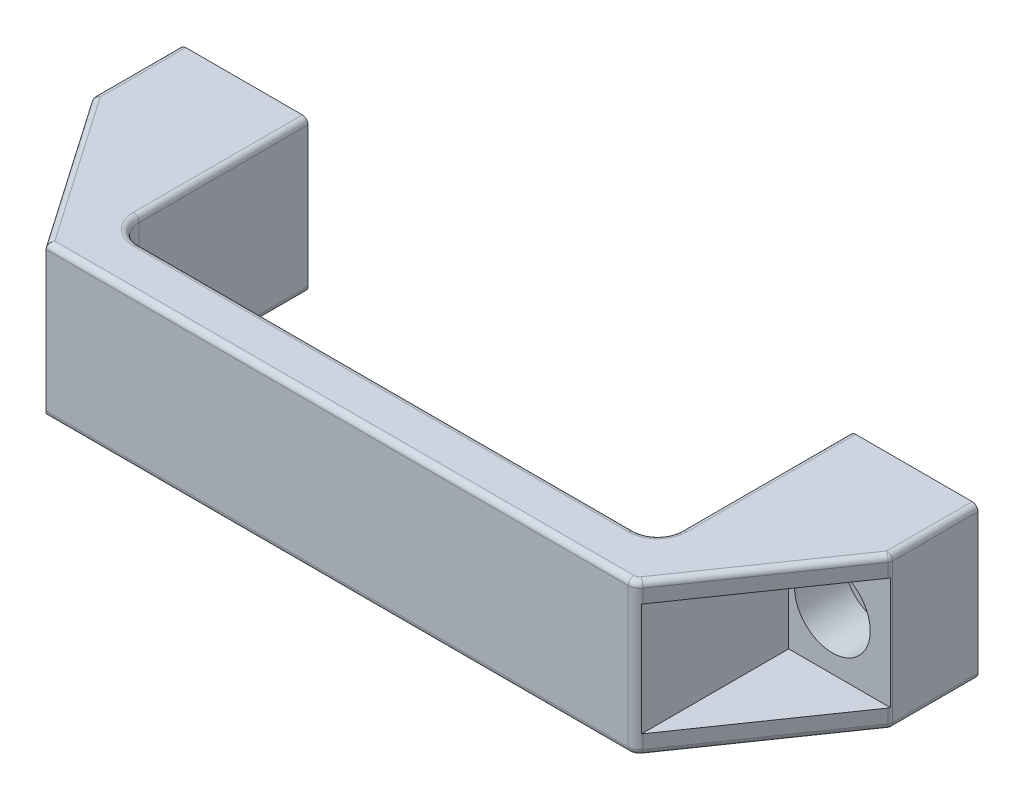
ISO-10303-21;
HEADER;
FILE_DESCRIPTION(('STEP AP214'),'2;1');
FILE_NAME('part.step','',(''),(''),'','','');
FILE_SCHEMA(('AUTOMOTIVE_DESIGN { 1 0 10303 214 1 1 1 1 }'));
ENDSEC;
DATA;
#1=APPLICATION_CONTEXT('core data for automotive mechanical design processes');
#2=APPLICATION_PROTOCOL_DEFINITION('international standard','automotive_design',2000,#1);
#3=PRODUCT_CONTEXT('',#1,'mechanical');
#4=PRODUCT('Part','Part','',(#3));
#5=PRODUCT_RELATED_PRODUCT_CATEGORY('part','',(#4));
#6=PRODUCT_DEFINITION_FORMATION('','',#4);
#7=PRODUCT_DEFINITION_CONTEXT('part definition',#1,'design');
#8=PRODUCT_DEFINITION('design','',#6,#7);
#9=PRODUCT_DEFINITION_SHAPE('','',#8);
#10=(LENGTH_UNIT() NAMED_UNIT(*) SI_UNIT(.MILLI.,.METRE.));
#11=(NAMED_UNIT(*) PLANE_ANGLE_UNIT() SI_UNIT($,.RADIAN.));
#12=(NAMED_UNIT(*) SI_UNIT($,.STERADIAN.) SOLID_ANGLE_UNIT());
#13=UNCERTAINTY_MEASURE_WITH_UNIT(LENGTH_MEASURE(1.E-05),#10,'distance_accuracy_value','');
#14=(GEOMETRIC_REPRESENTATION_CONTEXT(3) GLOBAL_UNCERTAINTY_ASSIGNED_CONTEXT((#13)) GLOBAL_UNIT_ASSIGNED_CONTEXT((#10,
#11,#12)) REPRESENTATION_CONTEXT('',''));
#15=CARTESIAN_POINT('',(0.,0.,0.));
#16=DIRECTION('',(0.,0.,1.));
#17=DIRECTION('',(1.,0.,0.));
#18=AXIS2_PLACEMENT_3D('',#15,#16,#17);
#19=CARTESIAN_POINT('',(-58.5,0.,6.5));
#20=DIRECTION('',(0.,0.,-1.));
#21=DIRECTION('',(-1.,0.,0.));
#22=AXIS2_PLACEMENT_3D('',#19,#20,#21);
#23=PLANE('',#22);
#24=CARTESIAN_POINT('',(-58.5,0.,6.49999999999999));
#25=DIRECTION('',(0.,0.,1.));
#26=DIRECTION('',(1.,0.,0.));
#27=AXIS2_PLACEMENT_3D('',#24,#25,#26);
#28=CIRCLE('',#27,4.25);
#29=CARTESIAN_POINT('',(-54.25,0.,6.49999999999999));
#30=VERTEX_POINT('',#29);
#31=EDGE_CURVE('E436',#30,#30,#28,.F.);
#32=ORIENTED_EDGE('',*,*,#31,.T.);
#33=EDGE_LOOP('',(#32));
#34=FACE_BOUND('',#33,.T.);
#35=CARTESIAN_POINT('',(-58.5,0.,6.5));
#36=DIRECTION('',(0.,0.,-1.));
#37=DIRECTION('',(0.,1.,0.));
#38=AXIS2_PLACEMENT_3D('',#35,#36,#37);
#39=CIRCLE('',#38,6.5);
#40=CARTESIAN_POINT('',(-58.5,6.5,6.49999999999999));
#41=VERTEX_POINT('',#40);
#42=EDGE_CURVE('E440',#41,#41,#39,.F.);
#43=ORIENTED_EDGE('',*,*,#42,.T.);
#44=EDGE_LOOP('',(#43));
#45=FACE_BOUND('',#44,.T.);
#46=ADVANCED_FACE('F15',(#34,#45),#23,.F.);
#47=CARTESIAN_POINT('',(58.5,0.,6.50000000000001));
#48=DIRECTION('',(0.,0.,-1.));
#49=DIRECTION('',(-1.,0.,0.));
#50=AXIS2_PLACEMENT_3D('',#47,#48,#49);
#51=PLANE('',#50);
#52=CARTESIAN_POINT('',(58.5,0.,6.50000000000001));
#53=DIRECTION('',(0.,0.,1.));
#54=DIRECTION('',(1.,0.,0.));
#55=AXIS2_PLACEMENT_3D('',#52,#53,#54);
#56=CIRCLE('',#55,4.25);
#57=CARTESIAN_POINT('',(62.75,0.,6.50000000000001));
#58=VERTEX_POINT('',#57);
#59=EDGE_CURVE('E253',#58,#58,#56,.F.);
#60=ORIENTED_EDGE('',*,*,#59,.T.);
#61=EDGE_LOOP('',(#60));
#62=FACE_BOUND('',#61,.T.);
#63=CARTESIAN_POINT('',(58.5,0.,6.50000000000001));
#64=DIRECTION('',(0.,0.,-1.));
#65=DIRECTION('',(0.,1.,0.));
#66=AXIS2_PLACEMENT_3D('',#63,#64,#65);
#67=CIRCLE('',#66,6.5);
#68=CARTESIAN_POINT('',(58.5,6.50000000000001,6.50000000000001));
#69=VERTEX_POINT('',#68);
#70=EDGE_CURVE('E19',#69,#69,#67,.F.);
#71=ORIENTED_EDGE('',*,*,#70,.T.);
#72=EDGE_LOOP('',(#71));
#73=FACE_BOUND('',#72,.T.);
#74=ADVANCED_FACE('F450',(#62,#73),#51,.F.);
#75=CARTESIAN_POINT('',(58.5,0.,15.));
#76=DIRECTION('',(0.,0.,-1.));
#77=DIRECTION('',(0.,1.,0.));
#78=AXIS2_PLACEMENT_3D('',#75,#76,#77);
#79=CYLINDRICAL_SURFACE('',#78,6.5);
#80=CARTESIAN_POINT('',(58.5,0.,15.));
#81=DIRECTION('',(0.,0.,-1.));
#82=DIRECTION('',(0.,1.,0.));
#83=AXIS2_PLACEMENT_3D('',#80,#81,#82);
#84=CIRCLE('',#83,6.5);
#85=CARTESIAN_POINT('',(58.5,6.50000000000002,15.));
#86=VERTEX_POINT('',#85);
#87=EDGE_CURVE('E231',#86,#86,#84,.T.);
#88=ORIENTED_EDGE('',*,*,#87,.F.);
#89=EDGE_LOOP('',(#88));
#90=FACE_BOUND('',#89,.T.);
#91=ORIENTED_EDGE('',*,*,#70,.F.);
#92=EDGE_LOOP('',(#91));
#93=FACE_BOUND('',#92,.T.);
#94=ADVANCED_FACE('F315',(#90,#93),#79,.F.);
#95=CARTESIAN_POINT('',(67.5,12.,14.6876235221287));
#96=DIRECTION('',(1.,0.,0.));
#97=DIRECTION('',(0.,1.,0.));
#98=AXIS2_PLACEMENT_3D('',#95,#96,#97);
#99=SPHERICAL_SURFACE('',#98,1.);
#100=CARTESIAN_POINT('',(67.5,12.,14.6876235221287));
#101=DIRECTION('',(0.,0.,1.));
#102=DIRECTION('',(1.,0.,0.));
#103=AXIS2_PLACEMENT_3D('',#100,#101,#102);
#104=CIRCLE('',#103,0.999999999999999);
#105=CARTESIAN_POINT('',(67.5,13.,14.6876235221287));
#106=VERTEX_POINT('',#105);
#107=CARTESIAN_POINT('',(68.5,12.,14.6876235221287));
#108=VERTEX_POINT('',#107);
#109=EDGE_CURVE('E227',#106,#108,#104,.F.);
#110=ORIENTED_EDGE('',*,*,#109,.F.);
#111=CARTESIAN_POINT('',(67.5,12.,14.6876235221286));
#112=DIRECTION('',(0.569209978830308,0.,-0.822192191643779));
#113=DIRECTION('',(-0.822192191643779,0.,-0.569209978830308));
#114=AXIS2_PLACEMENT_3D('',#111,#112,#113);
#115=CIRCLE('',#114,1.);
#116=CARTESIAN_POINT('',(68.3221921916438,12.,15.256833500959));
#117=VERTEX_POINT('',#116);
#118=EDGE_CURVE('E220',#117,#106,#115,.F.);
#119=ORIENTED_EDGE('',*,*,#118,.F.);
#120=CARTESIAN_POINT('',(67.5,12.,14.6876235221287));
#121=DIRECTION('',(0.,-1.,0.));
#122=DIRECTION('',(0.,0.,-1.));
#123=AXIS2_PLACEMENT_3D('',#120,#121,#122);
#124=CIRCLE('',#123,1.);
#125=EDGE_CURVE('E225',#108,#117,#124,.T.);
#126=ORIENTED_EDGE('',*,*,#125,.F.);
#127=EDGE_LOOP('',(#110,#119,#126));
#128=FACE_BOUND('',#127,.T.);
#129=ADVANCED_FACE('F222',(#128),#99,.T.);
#130=CARTESIAN_POINT('',(-58.5,0.,15.));
#131=DIRECTION('',(0.,0.,-1.));
#132=DIRECTION('',(0.,1.,0.));
#133=AXIS2_PLACEMENT_3D('',#130,#131,#132);
#134=CYLINDRICAL_SURFACE('',#133,6.5);
#135=CARTESIAN_POINT('',(-58.5,0.,15.));
#136=DIRECTION('',(0.,0.,-1.));
#137=DIRECTION('',(0.,1.,0.));
#138=AXIS2_PLACEMENT_3D('',#135,#136,#137);
#139=CIRCLE('',#138,6.5);
#140=CARTESIAN_POINT('',(-58.5,6.5,15.));
#141=VERTEX_POINT('',#140);
#142=EDGE_CURVE('E425',#141,#141,#139,.T.);
#143=ORIENTED_EDGE('',*,*,#142,.F.);
#144=EDGE_LOOP('',(#143));
#145=FACE_BOUND('',#144,.T.);
#146=ORIENTED_EDGE('',*,*,#42,.F.);
#147=EDGE_LOOP('',(#146));
#148=FACE_BOUND('',#147,.T.);
#149=ADVANCED_FACE('F307',(#145,#148),#134,.F.);
#150=CARTESIAN_POINT('',(-58.5,0.,0.));
#151=DIRECTION('',(0.,0.,1.));
#152=DIRECTION('',(1.,0.,0.));
#153=AXIS2_PLACEMENT_3D('',#150,#151,#152);
#154=CYLINDRICAL_SURFACE('',#153,4.25);
#155=CARTESIAN_POINT('',(-58.5,0.,0.));
#156=DIRECTION('',(0.,0.,1.));
#157=DIRECTION('',(1.,0.,0.));
#158=AXIS2_PLACEMENT_3D('',#155,#156,#157);
#159=CIRCLE('',#158,4.25);
#160=CARTESIAN_POINT('',(-54.25,0.,0.));
#161=VERTEX_POINT('',#160);
#162=EDGE_CURVE('E413',#161,#161,#159,.F.);
#163=ORIENTED_EDGE('',*,*,#162,.T.);
#164=EDGE_LOOP('',(#163));
#165=FACE_BOUND('',#164,.T.);
#166=ORIENTED_EDGE('',*,*,#31,.F.);
#167=EDGE_LOOP('',(#166));
#168=FACE_BOUND('',#167,.T.);
#169=ADVANCED_FACE('F303',(#165,#168),#154,.F.);
#170=CARTESIAN_POINT('',(-46.5,-13.,29.));
#171=DIRECTION('',(-1.,0.,0.));
#172=DIRECTION('',(0.,0.,1.));
#173=AXIS2_PLACEMENT_3D('',#170,#171,#172);
#174=PLANE('',#173);
#175=DIRECTION('',(0.,1.,0.));
#176=VECTOR('',#175,1.);
#177=CARTESIAN_POINT('',(-46.5,0.,0.));
#178=LINE('',#177,#176);
#179=CARTESIAN_POINT('',(-46.5,-12.,0.));
#180=VERTEX_POINT('',#179);
#181=CARTESIAN_POINT('',(-46.5,12.,0.));
#182=VERTEX_POINT('',#181);
#183=EDGE_CURVE('E424',#180,#182,#178,.T.);
#184=ORIENTED_EDGE('',*,*,#183,.T.);
#185=DIRECTION('',(0.,0.,-1.));
#186=VECTOR('',#185,1.);
#187=CARTESIAN_POINT('',(-46.5,12.,14.5));
#188=LINE('',#187,#186);
#189=CARTESIAN_POINT('',(-46.5,12.,29.));
#190=VERTEX_POINT('',#189);
#191=EDGE_CURVE('E950',#190,#182,#188,.T.);
#192=ORIENTED_EDGE('',*,*,#191,.F.);
#193=DIRECTION('',(0.,1.,0.));
#194=VECTOR('',#193,1.);
#195=CARTESIAN_POINT('',(-46.5,-13.,29.));
#196=LINE('',#195,#194);
#197=CARTESIAN_POINT('',(-46.5,-12.,29.));
#198=VERTEX_POINT('',#197);
#199=EDGE_CURVE('E439',#190,#198,#196,.F.);
#200=ORIENTED_EDGE('',*,*,#199,.T.);
#201=DIRECTION('',(0.,0.,1.));
#202=VECTOR('',#201,1.);
#203=CARTESIAN_POINT('',(-46.5,-12.,14.5));
#204=LINE('',#203,#202);
#205=EDGE_CURVE('E412',#180,#198,#204,.T.);
#206=ORIENTED_EDGE('',*,*,#205,.F.);
#207=EDGE_LOOP('',(#184,#192,#200,#206));
#208=FACE_BOUND('',#207,.T.);
#209=ADVANCED_FACE('F299',(#208),#174,.F.);
#210=CARTESIAN_POINT('',(-42.5,-13.,29.));
#211=DIRECTION('',(0.,1.,0.));
#212=DIRECTION('',(0.,0.,1.));
#213=AXIS2_PLACEMENT_3D('',#210,#211,#212);
#214=CYLINDRICAL_SURFACE('',#213,4.);
#215=ORIENTED_EDGE('',*,*,#199,.F.);
#216=CARTESIAN_POINT('',(-42.5,12.,29.));
#217=DIRECTION('',(0.,-1.,0.));
#218=DIRECTION('',(0.,0.,-1.));
#219=AXIS2_PLACEMENT_3D('',#216,#217,#218);
#220=CIRCLE('',#219,4.);
#221=CARTESIAN_POINT('',(-42.5,12.,33.));
#222=VERTEX_POINT('',#221);
#223=EDGE_CURVE('E827',#222,#190,#220,.T.);
#224=ORIENTED_EDGE('',*,*,#223,.F.);
#225=DIRECTION('',(0.,1.,0.));
#226=VECTOR('',#225,1.);
#227=CARTESIAN_POINT('',(-42.5,-13.,33.));
#228=LINE('',#227,#226);
#229=CARTESIAN_POINT('',(-42.5,-12.,33.));
#230=VERTEX_POINT('',#229);
#231=EDGE_CURVE('E956',#222,#230,#228,.F.);
#232=ORIENTED_EDGE('',*,*,#231,.T.);
#233=CARTESIAN_POINT('',(-42.5,-12.,29.));
#234=DIRECTION('',(0.,1.,0.));
#235=DIRECTION('',(0.,0.,1.));
#236=AXIS2_PLACEMENT_3D('',#233,#234,#235);
#237=CIRCLE('',#236,4.);
#238=EDGE_CURVE('E733',#198,#230,#237,.T.);
#239=ORIENTED_EDGE('',*,*,#238,.F.);
#240=EDGE_LOOP('',(#215,#224,#232,#239));
#241=FACE_BOUND('',#240,.T.);
#242=ADVANCED_FACE('F295',(#241),#214,.F.);
#243=CARTESIAN_POINT('',(42.5,-13.,33.));
#244=DIRECTION('',(0.,0.,1.));
#245=DIRECTION('',(1.,0.,0.));
#246=AXIS2_PLACEMENT_3D('',#243,#244,#245);
#247=PLANE('',#246);
#248=ORIENTED_EDGE('',*,*,#231,.F.);
#249=DIRECTION('',(-1.,0.,0.));
#250=VECTOR('',#249,1.);
#251=CARTESIAN_POINT('',(-12.5,12.,33.));
#252=LINE('',#251,#250);
#253=CARTESIAN_POINT('',(42.5,12.,33.));
#254=VERTEX_POINT('',#253);
#255=EDGE_CURVE('E828',#254,#222,#252,.T.);
#256=ORIENTED_EDGE('',*,*,#255,.F.);
#257=DIRECTION('',(0.,1.,0.));
#258=VECTOR('',#257,1.);
#259=CARTESIAN_POINT('',(42.5,-13.,33.));
#260=LINE('',#259,#258);
#261=CARTESIAN_POINT('',(42.5,-12.,33.));
#262=VERTEX_POINT('',#261);
#263=EDGE_CURVE('E1009',#254,#262,#260,.F.);
#264=ORIENTED_EDGE('',*,*,#263,.T.);
#265=DIRECTION('',(1.,0.,0.));
#266=VECTOR('',#265,1.);
#267=CARTESIAN_POINT('',(55.,-12.,33.));
#268=LINE('',#267,#266);
#269=EDGE_CURVE('E726',#230,#262,#268,.T.);
#270=ORIENTED_EDGE('',*,*,#269,.F.);
#271=EDGE_LOOP('',(#248,#256,#264,#270));
#272=FACE_BOUND('',#271,.T.);
#273=ADVANCED_FACE('F291',(#272),#247,.F.);
#274=CARTESIAN_POINT('',(42.5,-13.,29.));
#275=DIRECTION('',(0.,1.,0.));
#276=DIRECTION('',(0.,0.,1.));
#277=AXIS2_PLACEMENT_3D('',#274,#275,#276);
#278=CYLINDRICAL_SURFACE('',#277,4.00000000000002);
#279=ORIENTED_EDGE('',*,*,#263,.F.);
#280=CARTESIAN_POINT('',(42.5,12.,29.));
#281=DIRECTION('',(0.,-1.,0.));
#282=DIRECTION('',(0.,0.,-1.));
#283=AXIS2_PLACEMENT_3D('',#280,#281,#282);
#284=CIRCLE('',#283,4.00000000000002);
#285=CARTESIAN_POINT('',(46.5,12.,29.));
#286=VERTEX_POINT('',#285);
#287=EDGE_CURVE('E320',#286,#254,#284,.T.);
#288=ORIENTED_EDGE('',*,*,#287,.F.);
#289=DIRECTION('',(0.,1.,0.));
#290=VECTOR('',#289,1.);
#291=CARTESIAN_POINT('',(46.5,-13.,29.));
#292=LINE('',#291,#290);
#293=CARTESIAN_POINT('',(46.5,-12.,29.));
#294=VERTEX_POINT('',#293);
#295=EDGE_CURVE('E435',#286,#294,#292,.F.);
#296=ORIENTED_EDGE('',*,*,#295,.T.);
#297=CARTESIAN_POINT('',(42.5,-12.,29.));
#298=DIRECTION('',(0.,1.,0.));
#299=DIRECTION('',(0.,0.,1.));
#300=AXIS2_PLACEMENT_3D('',#297,#298,#299);
#301=CIRCLE('',#300,4.00000000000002);
#302=EDGE_CURVE('E698',#262,#294,#301,.T.);
#303=ORIENTED_EDGE('',*,*,#302,.F.);
#304=EDGE_LOOP('',(#279,#288,#296,#303));
#305=FACE_BOUND('',#304,.T.);
#306=ADVANCED_FACE('F287',(#305),#278,.F.);
#307=CARTESIAN_POINT('',(46.5,-13.,0.));
#308=DIRECTION('',(1.,0.,0.));
#309=DIRECTION('',(0.,0.,-1.));
#310=AXIS2_PLACEMENT_3D('',#307,#308,#309);
#311=PLANE('',#310);
#312=ORIENTED_EDGE('',*,*,#295,.F.);
#313=DIRECTION('',(0.,0.,1.));
#314=VECTOR('',#313,1.);
#315=CARTESIAN_POINT('',(46.5,12.,0.));
#316=LINE('',#315,#314);
#317=CARTESIAN_POINT('',(46.5,12.,0.));
#318=VERTEX_POINT('',#317);
#319=EDGE_CURVE('E859',#318,#286,#316,.T.);
#320=ORIENTED_EDGE('',*,*,#319,.F.);
#321=DIRECTION('',(0.,1.,0.));
#322=VECTOR('',#321,1.);
#323=CARTESIAN_POINT('',(46.5,0.,0.));
#324=LINE('',#323,#322);
#325=CARTESIAN_POINT('',(46.5,-12.,0.));
#326=VERTEX_POINT('',#325);
#327=EDGE_CURVE('E401',#318,#326,#324,.F.);
#328=ORIENTED_EDGE('',*,*,#327,.T.);
#329=DIRECTION('',(0.,0.,-1.));
#330=VECTOR('',#329,1.);
#331=CARTESIAN_POINT('',(46.5,-12.,0.));
#332=LINE('',#331,#330);
#333=EDGE_CURVE('E694',#294,#326,#332,.T.);
#334=ORIENTED_EDGE('',*,*,#333,.F.);
#335=EDGE_LOOP('',(#312,#320,#328,#334));
#336=FACE_BOUND('',#335,.T.);
#337=ADVANCED_FACE('F283',(#336),#311,.F.);
#338=CARTESIAN_POINT('',(58.5,0.,0.));
#339=DIRECTION('',(0.,0.,1.));
#340=DIRECTION('',(1.,0.,0.));
#341=AXIS2_PLACEMENT_3D('',#338,#339,#340);
#342=CYLINDRICAL_SURFACE('',#341,4.25);
#343=CARTESIAN_POINT('',(58.5,0.,0.));
#344=DIRECTION('',(0.,0.,1.));
#345=DIRECTION('',(1.,0.,0.));
#346=AXIS2_PLACEMENT_3D('',#343,#344,#345);
#347=CIRCLE('',#346,4.25);
#348=CARTESIAN_POINT('',(62.75,0.,0.));
#349=VERTEX_POINT('',#348);
#350=EDGE_CURVE('E396',#349,#349,#347,.F.);
#351=ORIENTED_EDGE('',*,*,#350,.T.);
#352=EDGE_LOOP('',(#351));
#353=FACE_BOUND('',#352,.T.);
#354=ORIENTED_EDGE('',*,*,#59,.F.);
#355=EDGE_LOOP('',(#354));
#356=FACE_BOUND('',#355,.T.);
#357=ADVANCED_FACE('F279',(#353,#356),#342,.F.);
#358=CARTESIAN_POINT('',(68.5,12.,0.));
#359=DIRECTION('',(1.,0.,0.));
#360=DIRECTION('',(0.,0.,-1.));
#361=AXIS2_PLACEMENT_3D('',#358,#359,#360);
#362=PLANE('',#361);
#363=DIRECTION('',(0.,1.,0.));
#364=VECTOR('',#363,1.);
#365=CARTESIAN_POINT('',(68.5,0.,0.));
#366=LINE('',#365,#364);
#367=CARTESIAN_POINT('',(68.5,-12.,0.));
#368=VERTEX_POINT('',#367);
#369=CARTESIAN_POINT('',(68.5,12.,0.));
#370=VERTEX_POINT('',#369);
#371=EDGE_CURVE('E407',#368,#370,#366,.T.);
#372=ORIENTED_EDGE('',*,*,#371,.T.);
#373=DIRECTION('',(0.,0.,1.));
#374=VECTOR('',#373,1.);
#375=CARTESIAN_POINT('',(68.5,12.,0.));
#376=LINE('',#375,#374);
#377=EDGE_CURVE('E867',#108,#370,#376,.F.);
#378=ORIENTED_EDGE('',*,*,#377,.F.);
#379=DIRECTION('',(0.,-1.,0.));
#380=VECTOR('',#379,1.);
#381=CARTESIAN_POINT('',(68.5,-0.500000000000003,14.6876235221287));
#382=LINE('',#381,#380);
#383=CARTESIAN_POINT('',(68.5,-12.,14.6876235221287));
#384=VERTEX_POINT('',#383);
#385=EDGE_CURVE('E251',#384,#108,#382,.F.);
#386=ORIENTED_EDGE('',*,*,#385,.F.);
#387=DIRECTION('',(0.,0.,1.));
#388=VECTOR('',#387,1.);
#389=CARTESIAN_POINT('',(68.5,-12.,0.));
#390=LINE('',#389,#388);
#391=EDGE_CURVE('E267',#368,#384,#390,.T.);
#392=ORIENTED_EDGE('',*,*,#391,.F.);
#393=EDGE_LOOP('',(#372,#378,#386,#392));
#394=FACE_BOUND('',#393,.T.);
#395=ADVANCED_FACE('F274',(#394),#362,.T.);
#396=CARTESIAN_POINT('',(67.5,-12.,14.6876235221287));
#397=DIRECTION('',(1.,0.,0.));
#398=DIRECTION('',(0.,1.,0.));
#399=AXIS2_PLACEMENT_3D('',#396,#397,#398);
#400=SPHERICAL_SURFACE('',#399,1.);
#401=CARTESIAN_POINT('',(67.5,-12.,14.6876235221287));
#402=DIRECTION('',(0.,0.,1.));
#403=DIRECTION('',(1.,0.,0.));
#404=AXIS2_PLACEMENT_3D('',#401,#402,#403);
#405=CIRCLE('',#404,1.);
#406=CARTESIAN_POINT('',(67.4999999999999,-13.,14.6876235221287));
#407=VERTEX_POINT('',#406);
#408=EDGE_CURVE('E395',#384,#407,#405,.F.);
#409=ORIENTED_EDGE('',*,*,#408,.F.);
#410=CARTESIAN_POINT('',(67.5,-12.,14.6876235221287));
#411=DIRECTION('',(0.,-1.,0.));
#412=DIRECTION('',(0.,0.,-1.));
#413=AXIS2_PLACEMENT_3D('',#410,#411,#412);
#414=CIRCLE('',#413,1.);
#415=CARTESIAN_POINT('',(68.3221921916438,-12.,15.256833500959));
#416=VERTEX_POINT('',#415);
#417=EDGE_CURVE('E252',#416,#384,#414,.F.);
#418=ORIENTED_EDGE('',*,*,#417,.F.);
#419=CARTESIAN_POINT('',(67.5,-12.,14.6876235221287));
#420=DIRECTION('',(-0.569209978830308,0.,0.822192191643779));
#421=DIRECTION('',(0.822192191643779,0.,0.569209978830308));
#422=AXIS2_PLACEMENT_3D('',#419,#420,#421);
#423=CIRCLE('',#422,1.);
#424=EDGE_CURVE('E389',#407,#416,#423,.T.);
#425=ORIENTED_EDGE('',*,*,#424,.F.);
#426=EDGE_LOOP('',(#409,#418,#425));
#427=FACE_BOUND('',#426,.T.);
#428=ADVANCED_FACE('F270',(#427),#400,.T.);
#429=CARTESIAN_POINT('',(67.5,-0.500000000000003,14.6876235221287));
#430=DIRECTION('',(0.,-1.,0.));
#431=DIRECTION('',(0.,0.,-1.));
#432=AXIS2_PLACEMENT_3D('',#429,#430,#431);
#433=CYLINDRICAL_SURFACE('',#432,1.);
#434=ORIENTED_EDGE('',*,*,#417,.T.);
#435=ORIENTED_EDGE('',*,*,#385,.T.);
#436=ORIENTED_EDGE('',*,*,#125,.T.);
#437=DIRECTION('',(0.,1.,0.));
#438=VECTOR('',#437,1.);
#439=CARTESIAN_POINT('',(68.3221921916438,-13.,15.256833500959));
#440=LINE('',#439,#438);
#441=CARTESIAN_POINT('',(68.3221921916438,9.65,15.256833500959));
#442=VERTEX_POINT('',#441);
#443=EDGE_CURVE('E242',#117,#442,#440,.F.);
#444=ORIENTED_EDGE('',*,*,#443,.T.);
#445=CARTESIAN_POINT('',(67.5,9.65,14.6876235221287));
#446=DIRECTION('',(0.,-1.,0.));
#447=DIRECTION('',(0.,0.,-1.));
#448=AXIS2_PLACEMENT_3D('',#445,#446,#447);
#449=CIRCLE('',#448,1.);
#450=CARTESIAN_POINT('',(68.4499583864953,9.65000000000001,15.));
#451=VERTEX_POINT('',#450);
#452=EDGE_CURVE('E387',#442,#451,#449,.F.);
#453=ORIENTED_EDGE('',*,*,#452,.T.);
#454=DIRECTION('',(0.,1.,0.));
#455=VECTOR('',#454,1.);
#456=CARTESIAN_POINT('',(68.4499583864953,0.,15.));
#457=LINE('',#456,#455);
#458=CARTESIAN_POINT('',(68.4499583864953,-9.65,15.));
#459=VERTEX_POINT('',#458);
#460=EDGE_CURVE('E323',#459,#451,#457,.T.);
#461=ORIENTED_EDGE('',*,*,#460,.F.);
#462=CARTESIAN_POINT('',(67.5,-9.65,14.6876235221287));
#463=DIRECTION('',(0.,-1.,0.));
#464=DIRECTION('',(0.,0.,-1.));
#465=AXIS2_PLACEMENT_3D('',#462,#463,#464);
#466=CIRCLE('',#465,1.);
#467=CARTESIAN_POINT('',(68.3221921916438,-9.65,15.256833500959));
#468=VERTEX_POINT('',#467);
#469=EDGE_CURVE('E383',#459,#468,#466,.T.);
#470=ORIENTED_EDGE('',*,*,#469,.T.);
#471=DIRECTION('',(0.,1.,0.));
#472=VECTOR('',#471,1.);
#473=CARTESIAN_POINT('',(68.3221921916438,-13.,15.256833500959));
#474=LINE('',#473,#472);
#475=EDGE_CURVE('E260',#468,#416,#474,.F.);
#476=ORIENTED_EDGE('',*,*,#475,.T.);
#477=EDGE_LOOP('',(#434,#435,#436,#444,#453,#461,#470,#476));
#478=FACE_BOUND('',#477,.T.);
#479=ADVANCED_FACE('F248',(#478),#433,.T.);
#480=CARTESIAN_POINT('',(59.75,0.,15.));
#481=DIRECTION('',(0.,0.,1.));
#482=DIRECTION('',(1.,0.,0.));
#483=AXIS2_PLACEMENT_3D('',#480,#481,#482);
#484=PLANE('',#483);
#485=ORIENTED_EDGE('',*,*,#87,.T.);
#486=EDGE_LOOP('',(#485));
#487=FACE_BOUND('',#486,.T.);
#488=DIRECTION('',(0.,1.,0.));
#489=VECTOR('',#488,1.);
#490=CARTESIAN_POINT('',(51.,-9.65,15.));
#491=LINE('',#490,#489);
#492=CARTESIAN_POINT('',(51.,9.65000000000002,15.));
#493=VERTEX_POINT('',#492);
#494=CARTESIAN_POINT('',(51.,-9.65,15.));
#495=VERTEX_POINT('',#494);
#496=EDGE_CURVE('E670',#493,#495,#491,.F.);
#497=ORIENTED_EDGE('',*,*,#496,.T.);
#498=DIRECTION('',(1.,0.,0.));
#499=VECTOR('',#498,1.);
#500=CARTESIAN_POINT('',(68.5,-9.65,15.));
#501=LINE('',#500,#499);
#502=EDGE_CURVE('E386',#495,#459,#501,.T.);
#503=ORIENTED_EDGE('',*,*,#502,.T.);
#504=ORIENTED_EDGE('',*,*,#460,.T.);
#505=DIRECTION('',(1.,0.,0.));
#506=VECTOR('',#505,1.);
#507=CARTESIAN_POINT('',(51.,9.65000000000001,15.));
#508=LINE('',#507,#506);
#509=EDGE_CURVE('E243',#451,#493,#508,.F.);
#510=ORIENTED_EDGE('',*,*,#509,.T.);
#511=EDGE_LOOP('',(#497,#503,#504,#510));
#512=FACE_BOUND('',#511,.T.);
#513=ADVANCED_FACE('F875',(#487,#512),#484,.T.);
#514=CARTESIAN_POINT('',(40.1558078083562,12.,54.1847900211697));
#515=DIRECTION('',(0.569209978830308,0.,-0.822192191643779));
#516=DIRECTION('',(-0.822192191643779,0.,-0.569209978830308));
#517=AXIS2_PLACEMENT_3D('',#514,#515,#516);
#518=CYLINDRICAL_SURFACE('',#517,1.);
#519=ORIENTED_EDGE('',*,*,#118,.T.);
#520=DIRECTION('',(0.569209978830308,0.,-0.822192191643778));
#521=VECTOR('',#520,1.);
#522=CARTESIAN_POINT('',(50.2742862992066,13.,39.5692099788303));
#523=LINE('',#522,#521);
#524=CARTESIAN_POINT('',(50.2742862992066,13.,39.5692099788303));
#525=VERTEX_POINT('',#524);
#526=EDGE_CURVE('E589',#525,#106,#523,.T.);
#527=ORIENTED_EDGE('',*,*,#526,.F.);
#528=CARTESIAN_POINT('',(50.2742862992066,12.,39.5692099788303));
#529=DIRECTION('',(-0.569209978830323,0.,0.822192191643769));
#530=DIRECTION('',(0.822192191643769,0.,0.569209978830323));
#531=AXIS2_PLACEMENT_3D('',#528,#529,#530);
#532=CIRCLE('',#531,0.999999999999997);
#533=CARTESIAN_POINT('',(51.0964784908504,12.,40.1384199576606));
#534=VERTEX_POINT('',#533);
#535=EDGE_CURVE('E237',#534,#525,#532,.T.);
#536=ORIENTED_EDGE('',*,*,#535,.F.);
#537=DIRECTION('',(-0.569209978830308,0.,0.822192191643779));
#538=VECTOR('',#537,1.);
#539=CARTESIAN_POINT('',(50.5,12.,41.));
#540=LINE('',#539,#538);
#541=EDGE_CURVE('E235',#534,#117,#540,.F.);
#542=ORIENTED_EDGE('',*,*,#541,.T.);
#543=EDGE_LOOP('',(#519,#527,#536,#542));
#544=FACE_BOUND('',#543,.T.);
#545=ADVANCED_FACE('F236',(#544),#518,.T.);
#546=CARTESIAN_POINT('',(67.5,12.,0.));
#547=DIRECTION('',(0.,0.,1.));
#548=DIRECTION('',(1.,0.,0.));
#549=AXIS2_PLACEMENT_3D('',#546,#547,#548);
#550=CYLINDRICAL_SURFACE('',#549,0.999999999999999);
#551=CARTESIAN_POINT('',(67.5,12.,0.));
#552=DIRECTION('',(0.,0.,1.));
#553=DIRECTION('',(1.,0.,0.));
#554=AXIS2_PLACEMENT_3D('',#551,#552,#553);
#555=CIRCLE('',#554,0.999999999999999);
#556=CARTESIAN_POINT('',(67.5,13.,0.));
#557=VERTEX_POINT('',#556);
#558=EDGE_CURVE('E405',#370,#557,#555,.T.);
#559=ORIENTED_EDGE('',*,*,#558,.T.);
#560=DIRECTION('',(0.,0.,1.));
#561=VECTOR('',#560,1.);
#562=CARTESIAN_POINT('',(67.5,13.,0.));
#563=LINE('',#562,#561);
#564=EDGE_CURVE('E652',#106,#557,#563,.F.);
#565=ORIENTED_EDGE('',*,*,#564,.F.);
#566=ORIENTED_EDGE('',*,*,#109,.T.);
#567=ORIENTED_EDGE('',*,*,#377,.T.);
#568=EDGE_LOOP('',(#559,#565,#566,#567));
#569=FACE_BOUND('',#568,.T.);
#570=ADVANCED_FACE('F1116',(#569),#550,.T.);
#571=CARTESIAN_POINT('',(47.5,12.,0.));
#572=DIRECTION('',(0.,0.,1.));
#573=DIRECTION('',(1.,0.,0.));
#574=AXIS2_PLACEMENT_3D('',#571,#572,#573);
#575=CYLINDRICAL_SURFACE('',#574,1.);
#576=CARTESIAN_POINT('',(47.5,12.,29.));
#577=DIRECTION('',(0.,0.,1.));
#578=DIRECTION('',(1.,0.,0.));
#579=AXIS2_PLACEMENT_3D('',#576,#577,#578);
#580=CIRCLE('',#579,1.);
#581=CARTESIAN_POINT('',(47.5,13.,29.));
#582=VERTEX_POINT('',#581);
#583=EDGE_CURVE('E851',#582,#286,#580,.T.);
#584=ORIENTED_EDGE('',*,*,#583,.F.);
#585=DIRECTION('',(0.,0.,1.));
#586=VECTOR('',#585,1.);
#587=CARTESIAN_POINT('',(47.5,13.,0.));
#588=LINE('',#587,#586);
#589=CARTESIAN_POINT('',(47.5,13.,0.));
#590=VERTEX_POINT('',#589);
#591=EDGE_CURVE('E644',#590,#582,#588,.T.);
#592=ORIENTED_EDGE('',*,*,#591,.F.);
#593=CARTESIAN_POINT('',(47.5,12.,0.));
#594=DIRECTION('',(0.,0.,1.));
#595=DIRECTION('',(1.,0.,0.));
#596=AXIS2_PLACEMENT_3D('',#593,#594,#595);
#597=CIRCLE('',#596,1.);
#598=EDGE_CURVE('E402',#590,#318,#597,.T.);
#599=ORIENTED_EDGE('',*,*,#598,.T.);
#600=ORIENTED_EDGE('',*,*,#319,.T.);
#601=EDGE_LOOP('',(#584,#592,#599,#600));
#602=FACE_BOUND('',#601,.T.);
#603=ADVANCED_FACE('F845',(#602),#575,.T.);
#604=CARTESIAN_POINT('',(42.5,12.,29.));
#605=DIRECTION('',(0.,-1.,0.));
#606=DIRECTION('',(0.,0.,-1.));
#607=AXIS2_PLACEMENT_3D('',#604,#605,#606);
#608=TOROIDAL_SURFACE('',#607,5.00000000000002,1.);
#609=ORIENTED_EDGE('',*,*,#583,.T.);
#610=ORIENTED_EDGE('',*,*,#287,.T.);
#611=CARTESIAN_POINT('',(42.5,12.,34.));
#612=DIRECTION('',(-1.,0.,0.));
#613=DIRECTION('',(0.,0.,1.));
#614=AXIS2_PLACEMENT_3D('',#611,#612,#613);
#615=CIRCLE('',#614,1.);
#616=CARTESIAN_POINT('',(42.5,13.,34.));
#617=VERTEX_POINT('',#616);
#618=EDGE_CURVE('E831',#617,#254,#615,.T.);
#619=ORIENTED_EDGE('',*,*,#618,.F.);
#620=CARTESIAN_POINT('',(42.5,13.,29.));
#621=DIRECTION('',(0.,1.,0.));
#622=DIRECTION('',(0.,0.,1.));
#623=AXIS2_PLACEMENT_3D('',#620,#621,#622);
#624=CIRCLE('',#623,5.00000000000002);
#625=EDGE_CURVE('E641',#582,#617,#624,.F.);
#626=ORIENTED_EDGE('',*,*,#625,.F.);
#627=EDGE_LOOP('',(#609,#610,#619,#626));
#628=FACE_BOUND('',#627,.T.);
#629=ADVANCED_FACE('F841',(#628),#608,.T.);
#630=CARTESIAN_POINT('',(-12.5,12.,34.));
#631=DIRECTION('',(-1.,0.,0.));
#632=DIRECTION('',(0.,0.,1.));
#633=AXIS2_PLACEMENT_3D('',#630,#631,#632);
#634=CYLINDRICAL_SURFACE('',#633,1.);
#635=ORIENTED_EDGE('',*,*,#618,.T.);
#636=ORIENTED_EDGE('',*,*,#255,.T.);
#637=CARTESIAN_POINT('',(-42.5,12.,34.));
#638=DIRECTION('',(-1.,0.,0.));
#639=DIRECTION('',(0.,0.,1.));
#640=AXIS2_PLACEMENT_3D('',#637,#638,#639);
#641=CIRCLE('',#640,1.);
#642=CARTESIAN_POINT('',(-42.5,13.,34.));
#643=VERTEX_POINT('',#642);
#644=EDGE_CURVE('E820',#643,#222,#641,.T.);
#645=ORIENTED_EDGE('',*,*,#644,.F.);
#646=DIRECTION('',(1.,0.,0.));
#647=VECTOR('',#646,1.);
#648=CARTESIAN_POINT('',(-67.5,13.,34.));
#649=LINE('',#648,#647);
#650=EDGE_CURVE('E638',#617,#643,#649,.F.);
#651=ORIENTED_EDGE('',*,*,#650,.F.);
#652=EDGE_LOOP('',(#635,#636,#645,#651));
#653=FACE_BOUND('',#652,.T.);
#654=ADVANCED_FACE('F805',(#653),#634,.T.);
#655=CARTESIAN_POINT('',(-42.5,12.,29.));
#656=DIRECTION('',(0.,-1.,0.));
#657=DIRECTION('',(0.,0.,-1.));
#658=AXIS2_PLACEMENT_3D('',#655,#656,#657);
#659=TOROIDAL_SURFACE('',#658,5.,1.);
#660=ORIENTED_EDGE('',*,*,#644,.T.);
#661=ORIENTED_EDGE('',*,*,#223,.T.);
#662=CARTESIAN_POINT('',(-47.5,12.,29.));
#663=DIRECTION('',(0.,0.,-1.));
#664=DIRECTION('',(-1.,0.,0.));
#665=AXIS2_PLACEMENT_3D('',#662,#663,#664);
#666=CIRCLE('',#665,1.);
#667=CARTESIAN_POINT('',(-47.5,13.,29.));
#668=VERTEX_POINT('',#667);
#669=EDGE_CURVE('E981',#668,#190,#666,.T.);
#670=ORIENTED_EDGE('',*,*,#669,.F.);
#671=CARTESIAN_POINT('',(-42.5,13.,29.));
#672=DIRECTION('',(0.,1.,0.));
#673=DIRECTION('',(-1.,0.,0.));
#674=AXIS2_PLACEMENT_3D('',#671,#672,#673);
#675=CIRCLE('',#674,5.);
#676=EDGE_CURVE('E623',#643,#668,#675,.F.);
#677=ORIENTED_EDGE('',*,*,#676,.F.);
#678=EDGE_LOOP('',(#660,#661,#670,#677));
#679=FACE_BOUND('',#678,.T.);
#680=ADVANCED_FACE('F799',(#679),#659,.T.);
#681=CARTESIAN_POINT('',(-47.5,12.,14.5));
#682=DIRECTION('',(0.,0.,-1.));
#683=DIRECTION('',(-1.,0.,0.));
#684=AXIS2_PLACEMENT_3D('',#681,#682,#683);
#685=CYLINDRICAL_SURFACE('',#684,1.);
#686=ORIENTED_EDGE('',*,*,#669,.T.);
#687=ORIENTED_EDGE('',*,*,#191,.T.);
#688=CARTESIAN_POINT('',(-47.5,12.,0.));
#689=DIRECTION('',(0.,0.,-1.));
#690=DIRECTION('',(-1.,0.,0.));
#691=AXIS2_PLACEMENT_3D('',#688,#689,#690);
#692=CIRCLE('',#691,1.);
#693=CARTESIAN_POINT('',(-47.5,13.,0.));
#694=VERTEX_POINT('',#693);
#695=EDGE_CURVE('E421',#182,#694,#692,.F.);
#696=ORIENTED_EDGE('',*,*,#695,.T.);
#697=DIRECTION('',(0.,0.,1.));
#698=VECTOR('',#697,1.);
#699=CARTESIAN_POINT('',(-47.5,13.,0.));
#700=LINE('',#699,#698);
#701=EDGE_CURVE('E627',#668,#694,#700,.F.);
#702=ORIENTED_EDGE('',*,*,#701,.F.);
#703=EDGE_LOOP('',(#686,#687,#696,#702));
#704=FACE_BOUND('',#703,.T.);
#705=ADVANCED_FACE('F795',(#704),#685,.T.);
#706=CARTESIAN_POINT('',(-67.5,12.,0.));
#707=DIRECTION('',(0.,0.,1.));
#708=DIRECTION('',(1.,0.,0.));
#709=AXIS2_PLACEMENT_3D('',#706,#707,#708);
#710=CYLINDRICAL_SURFACE('',#709,0.999999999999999);
#711=CARTESIAN_POINT('',(-67.5,12.,0.));
#712=DIRECTION('',(0.,0.,1.));
#713=DIRECTION('',(1.,0.,0.));
#714=AXIS2_PLACEMENT_3D('',#711,#712,#713);
#715=CIRCLE('',#714,0.999999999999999);
#716=CARTESIAN_POINT('',(-67.5,13.,0.));
#717=VERTEX_POINT('',#716);
#718=CARTESIAN_POINT('',(-68.5,12.,0.));
#719=VERTEX_POINT('',#718);
#720=EDGE_CURVE('E418',#717,#719,#715,.T.);
#721=ORIENTED_EDGE('',*,*,#720,.T.);
#722=DIRECTION('',(0.,0.,1.));
#723=VECTOR('',#722,1.);
#724=CARTESIAN_POINT('',(-68.5,12.,0.));
#725=LINE('',#724,#723);
#726=CARTESIAN_POINT('',(-68.5,12.,14.6876235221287));
#727=VERTEX_POINT('',#726);
#728=EDGE_CURVE('E429',#727,#719,#725,.F.);
#729=ORIENTED_EDGE('',*,*,#728,.F.);
#730=CARTESIAN_POINT('',(-67.5,12.,14.6876235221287));
#731=DIRECTION('',(0.,0.,1.));
#732=DIRECTION('',(1.,0.,0.));
#733=AXIS2_PLACEMENT_3D('',#730,#731,#732);
#734=CIRCLE('',#733,1.);
#735=CARTESIAN_POINT('',(-67.5,13.,14.6876235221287));
#736=VERTEX_POINT('',#735);
#737=EDGE_CURVE('E780',#736,#727,#734,.T.);
#738=ORIENTED_EDGE('',*,*,#737,.F.);
#739=DIRECTION('',(0.,0.,1.));
#740=VECTOR('',#739,1.);
#741=CARTESIAN_POINT('',(-67.5,13.,0.));
#742=LINE('',#741,#740);
#743=EDGE_CURVE('E774',#717,#736,#742,.T.);
#744=ORIENTED_EDGE('',*,*,#743,.F.);
#745=EDGE_LOOP('',(#721,#729,#738,#744));
#746=FACE_BOUND('',#745,.T.);
#747=ADVANCED_FACE('F790',(#746),#710,.T.);
#748=CARTESIAN_POINT('',(-67.5,12.,14.6876235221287));
#749=DIRECTION('',(1.,0.,0.));
#750=DIRECTION('',(0.,1.,0.));
#751=AXIS2_PLACEMENT_3D('',#748,#749,#750);
#752=SPHERICAL_SURFACE('',#751,1.);
#753=ORIENTED_EDGE('',*,*,#737,.T.);
#754=CARTESIAN_POINT('',(-67.5,12.,14.6876235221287));
#755=DIRECTION('',(0.,1.,0.));
#756=DIRECTION('',(0.,0.,1.));
#757=AXIS2_PLACEMENT_3D('',#754,#755,#756);
#758=CIRCLE('',#757,1.);
#759=CARTESIAN_POINT('',(-68.3221921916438,12.,15.256833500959));
#760=VERTEX_POINT('',#759);
#761=EDGE_CURVE('E367',#760,#727,#758,.F.);
#762=ORIENTED_EDGE('',*,*,#761,.F.);
#763=CARTESIAN_POINT('',(-67.5,12.,14.6876235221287));
#764=DIRECTION('',(0.569209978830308,0.,0.822192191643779));
#765=DIRECTION('',(0.822192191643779,0.,-0.569209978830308));
#766=AXIS2_PLACEMENT_3D('',#763,#764,#765);
#767=CIRCLE('',#766,1.);
#768=EDGE_CURVE('E372',#736,#760,#767,.T.);
#769=ORIENTED_EDGE('',*,*,#768,.F.);
#770=EDGE_LOOP('',(#753,#762,#769));
#771=FACE_BOUND('',#770,.T.);
#772=ADVANCED_FACE('F785',(#771),#752,.T.);
#773=CARTESIAN_POINT('',(-68.5,-12.,0.));
#774=DIRECTION('',(-1.,0.,0.));
#775=DIRECTION('',(0.,0.,1.));
#776=AXIS2_PLACEMENT_3D('',#773,#774,#775);
#777=PLANE('',#776);
#778=DIRECTION('',(0.,1.,0.));
#779=VECTOR('',#778,1.);
#780=CARTESIAN_POINT('',(-68.5,0.,0.));
#781=LINE('',#780,#779);
#782=CARTESIAN_POINT('',(-68.5,-12.,0.));
#783=VERTEX_POINT('',#782);
#784=EDGE_CURVE('E417',#719,#783,#781,.F.);
#785=ORIENTED_EDGE('',*,*,#784,.T.);
#786=DIRECTION('',(0.,0.,1.));
#787=VECTOR('',#786,1.);
#788=CARTESIAN_POINT('',(-68.5,-12.,0.));
#789=LINE('',#788,#787);
#790=CARTESIAN_POINT('',(-68.5,-12.,14.6876235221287));
#791=VERTEX_POINT('',#790);
#792=EDGE_CURVE('E371',#791,#783,#789,.F.);
#793=ORIENTED_EDGE('',*,*,#792,.F.);
#794=DIRECTION('',(0.,1.,0.));
#795=VECTOR('',#794,1.);
#796=CARTESIAN_POINT('',(-68.5,-12.5,14.6876235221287));
#797=LINE('',#796,#795);
#798=EDGE_CURVE('E363',#727,#791,#797,.F.);
#799=ORIENTED_EDGE('',*,*,#798,.F.);
#800=ORIENTED_EDGE('',*,*,#728,.T.);
#801=EDGE_LOOP('',(#785,#793,#799,#800));
#802=FACE_BOUND('',#801,.T.);
#803=ADVANCED_FACE('F789',(#802),#777,.T.);
#804=CARTESIAN_POINT('',(-59.75,0.,15.));
#805=DIRECTION('',(0.,0.,1.));
#806=DIRECTION('',(1.,0.,0.));
#807=AXIS2_PLACEMENT_3D('',#804,#805,#806);
#808=PLANE('',#807);
#809=ORIENTED_EDGE('',*,*,#142,.T.);
#810=EDGE_LOOP('',(#809));
#811=FACE_BOUND('',#810,.T.);
#812=DIRECTION('',(0.,1.,0.));
#813=VECTOR('',#812,1.);
#814=CARTESIAN_POINT('',(-51.,9.64999999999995,15.));
#815=LINE('',#814,#813);
#816=CARTESIAN_POINT('',(-51.,-9.65000000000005,15.));
#817=VERTEX_POINT('',#816);
#818=CARTESIAN_POINT('',(-51.,9.64999999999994,15.));
#819=VERTEX_POINT('',#818);
#820=EDGE_CURVE('E428',#817,#819,#815,.T.);
#821=ORIENTED_EDGE('',*,*,#820,.T.);
#822=DIRECTION('',(1.,0.,0.));
#823=VECTOR('',#822,1.);
#824=CARTESIAN_POINT('',(-68.5,9.64999999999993,15.));
#825=LINE('',#824,#823);
#826=CARTESIAN_POINT('',(-68.4499583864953,9.64999999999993,15.));
#827=VERTEX_POINT('',#826);
#828=EDGE_CURVE('E377',#819,#827,#825,.F.);
#829=ORIENTED_EDGE('',*,*,#828,.T.);
#830=DIRECTION('',(0.,1.,0.));
#831=VECTOR('',#830,1.);
#832=CARTESIAN_POINT('',(-68.4499583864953,-12.5,15.));
#833=LINE('',#832,#831);
#834=CARTESIAN_POINT('',(-68.4499583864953,-9.65000000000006,15.));
#835=VERTEX_POINT('',#834);
#836=EDGE_CURVE('E362',#835,#827,#833,.T.);
#837=ORIENTED_EDGE('',*,*,#836,.F.);
#838=DIRECTION('',(1.,0.,0.));
#839=VECTOR('',#838,1.);
#840=CARTESIAN_POINT('',(-51.,-9.65000000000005,15.));
#841=LINE('',#840,#839);
#842=EDGE_CURVE('E546',#835,#817,#841,.T.);
#843=ORIENTED_EDGE('',*,*,#842,.T.);
#844=EDGE_LOOP('',(#821,#829,#837,#843));
#845=FACE_BOUND('',#844,.T.);
#846=ADVANCED_FACE('F1406',(#811,#845),#808,.T.);
#847=CARTESIAN_POINT('',(-51.,9.64999999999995,15.));
#848=DIRECTION('',(1.,0.,0.));
#849=DIRECTION('',(0.,0.,-1.));
#850=AXIS2_PLACEMENT_3D('',#847,#848,#849);
#851=PLANE('',#850);
#852=DIRECTION('',(0.,0.,1.));
#853=VECTOR('',#852,1.);
#854=CARTESIAN_POINT('',(-51.,9.64999999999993,15.));
#855=LINE('',#854,#853);
#856=CARTESIAN_POINT('',(-51.,9.64999999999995,39.6530248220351));
#857=VERTEX_POINT('',#856);
#858=EDGE_CURVE('E381',#857,#819,#855,.F.);
#859=ORIENTED_EDGE('',*,*,#858,.T.);
#860=ORIENTED_EDGE('',*,*,#820,.F.);
#861=DIRECTION('',(0.,0.,-1.));
#862=VECTOR('',#861,1.);
#863=CARTESIAN_POINT('',(-51.,-9.65000000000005,15.));
#864=LINE('',#863,#862);
#865=CARTESIAN_POINT('',(-51.,-9.65000000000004,39.6530248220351));
#866=VERTEX_POINT('',#865);
#867=EDGE_CURVE('E357',#817,#866,#864,.F.);
#868=ORIENTED_EDGE('',*,*,#867,.T.);
#869=DIRECTION('',(0.,-1.,0.));
#870=VECTOR('',#869,1.);
#871=CARTESIAN_POINT('',(-51.,-1.675,39.6530248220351));
#872=LINE('',#871,#870);
#873=EDGE_CURVE('E382',#857,#866,#872,.T.);
#874=ORIENTED_EDGE('',*,*,#873,.F.);
#875=EDGE_LOOP('',(#859,#860,#868,#874));
#876=FACE_BOUND('',#875,.T.);
#877=ADVANCED_FACE('F1398',(#876),#851,.F.);
#878=CARTESIAN_POINT('',(0.,0.,0.));
#879=DIRECTION('',(0.,0.,1.));
#880=DIRECTION('',(1.,0.,0.));
#881=AXIS2_PLACEMENT_3D('',#878,#879,#880);
#882=PLANE('',#881);
#883=ORIENTED_EDGE('',*,*,#162,.F.);
#884=EDGE_LOOP('',(#883));
#885=FACE_BOUND('',#884,.T.);
#886=DIRECTION('',(1.,0.,0.));
#887=VECTOR('',#886,1.);
#888=CARTESIAN_POINT('',(67.5,-13.,0.));
#889=LINE('',#888,#887);
#890=CARTESIAN_POINT('',(-67.5,-13.,0.));
#891=VERTEX_POINT('',#890);
#892=CARTESIAN_POINT('',(-47.5,-13.,0.));
#893=VERTEX_POINT('',#892);
#894=EDGE_CURVE('E541',#891,#893,#889,.T.);
#895=ORIENTED_EDGE('',*,*,#894,.F.);
#896=CARTESIAN_POINT('',(-67.5,-12.,0.));
#897=DIRECTION('',(0.,0.,1.));
#898=DIRECTION('',(1.,0.,0.));
#899=AXIS2_PLACEMENT_3D('',#896,#897,#898);
#900=CIRCLE('',#899,0.999999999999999);
#901=EDGE_CURVE('E368',#783,#891,#900,.T.);
#902=ORIENTED_EDGE('',*,*,#901,.F.);
#903=ORIENTED_EDGE('',*,*,#784,.F.);
#904=ORIENTED_EDGE('',*,*,#720,.F.);
#905=DIRECTION('',(1.,0.,0.));
#906=VECTOR('',#905,1.);
#907=CARTESIAN_POINT('',(-67.5,13.,0.));
#908=LINE('',#907,#906);
#909=EDGE_CURVE('E635',#694,#717,#908,.F.);
#910=ORIENTED_EDGE('',*,*,#909,.F.);
#911=ORIENTED_EDGE('',*,*,#695,.F.);
#912=ORIENTED_EDGE('',*,*,#183,.F.);
#913=CARTESIAN_POINT('',(-47.5,-12.,0.));
#914=DIRECTION('',(0.,0.,1.));
#915=DIRECTION('',(1.,0.,0.));
#916=AXIS2_PLACEMENT_3D('',#913,#914,#915);
#917=CIRCLE('',#916,1.);
#918=EDGE_CURVE('E408',#893,#180,#917,.T.);
#919=ORIENTED_EDGE('',*,*,#918,.F.);
#920=EDGE_LOOP('',(#895,#902,#903,#904,#910,#911,#912,#919));
#921=FACE_BOUND('',#920,.T.);
#922=ADVANCED_FACE('F976',(#885,#921),#882,.F.);
#923=CARTESIAN_POINT('',(-47.5,-12.,14.5));
#924=DIRECTION('',(0.,0.,1.));
#925=DIRECTION('',(1.,0.,0.));
#926=AXIS2_PLACEMENT_3D('',#923,#924,#925);
#927=CYLINDRICAL_SURFACE('',#926,1.);
#928=CARTESIAN_POINT('',(-47.5,-12.,29.));
#929=DIRECTION('',(0.,0.,1.));
#930=DIRECTION('',(-1.,0.,0.));
#931=AXIS2_PLACEMENT_3D('',#928,#929,#930);
#932=CIRCLE('',#931,1.);
#933=CARTESIAN_POINT('',(-47.5,-13.,29.));
#934=VERTEX_POINT('',#933);
#935=EDGE_CURVE('E750',#934,#198,#932,.T.);
#936=ORIENTED_EDGE('',*,*,#935,.F.);
#937=DIRECTION('',(0.,0.,-1.));
#938=VECTOR('',#937,1.);
#939=CARTESIAN_POINT('',(-47.5,-13.,0.));
#940=LINE('',#939,#938);
#941=EDGE_CURVE('E538',#893,#934,#940,.F.);
#942=ORIENTED_EDGE('',*,*,#941,.F.);
#943=ORIENTED_EDGE('',*,*,#918,.T.);
#944=ORIENTED_EDGE('',*,*,#205,.T.);
#945=EDGE_LOOP('',(#936,#942,#943,#944));
#946=FACE_BOUND('',#945,.T.);
#947=ADVANCED_FACE('F744',(#946),#927,.T.);
#948=CARTESIAN_POINT('',(-42.5,-12.,29.));
#949=DIRECTION('',(0.,1.,0.));
#950=DIRECTION('',(0.,0.,1.));
#951=AXIS2_PLACEMENT_3D('',#948,#949,#950);
#952=TOROIDAL_SURFACE('',#951,5.,1.);
#953=ORIENTED_EDGE('',*,*,#935,.T.);
#954=ORIENTED_EDGE('',*,*,#238,.T.);
#955=CARTESIAN_POINT('',(-42.5,-12.,34.));
#956=DIRECTION('',(1.,0.,0.));
#957=DIRECTION('',(0.,0.,-1.));
#958=AXIS2_PLACEMENT_3D('',#955,#956,#957);
#959=CIRCLE('',#958,1.);
#960=CARTESIAN_POINT('',(-42.5,-13.,34.));
#961=VERTEX_POINT('',#960);
#962=EDGE_CURVE('E729',#961,#230,#959,.T.);
#963=ORIENTED_EDGE('',*,*,#962,.F.);
#964=CARTESIAN_POINT('',(-42.5,-13.,29.));
#965=DIRECTION('',(0.,-1.,0.));
#966=DIRECTION('',(0.,0.,1.));
#967=AXIS2_PLACEMENT_3D('',#964,#965,#966);
#968=CIRCLE('',#967,5.);
#969=EDGE_CURVE('E535',#934,#961,#968,.F.);
#970=ORIENTED_EDGE('',*,*,#969,.F.);
#971=EDGE_LOOP('',(#953,#954,#963,#970));
#972=FACE_BOUND('',#971,.T.);
#973=ADVANCED_FACE('F740',(#972),#952,.T.);
#974=CARTESIAN_POINT('',(55.,-12.,34.));
#975=DIRECTION('',(1.,0.,0.));
#976=DIRECTION('',(0.,0.,-1.));
#977=AXIS2_PLACEMENT_3D('',#974,#975,#976);
#978=CYLINDRICAL_SURFACE('',#977,1.);
#979=ORIENTED_EDGE('',*,*,#962,.T.);
#980=ORIENTED_EDGE('',*,*,#269,.T.);
#981=CARTESIAN_POINT('',(42.5,-12.,34.));
#982=DIRECTION('',(1.,0.,0.));
#983=DIRECTION('',(0.,0.,1.));
#984=AXIS2_PLACEMENT_3D('',#981,#982,#983);
#985=CIRCLE('',#984,1.);
#986=CARTESIAN_POINT('',(42.5,-13.,34.));
#987=VERTEX_POINT('',#986);
#988=EDGE_CURVE('E718',#987,#262,#985,.T.);
#989=ORIENTED_EDGE('',*,*,#988,.F.);
#990=DIRECTION('',(1.,0.,0.));
#991=VECTOR('',#990,1.);
#992=CARTESIAN_POINT('',(67.5,-13.,34.));
#993=LINE('',#992,#991);
#994=EDGE_CURVE('E532',#961,#987,#993,.T.);
#995=ORIENTED_EDGE('',*,*,#994,.F.);
#996=EDGE_LOOP('',(#979,#980,#989,#995));
#997=FACE_BOUND('',#996,.T.);
#998=ADVANCED_FACE('F711',(#997),#978,.T.);
#999=CARTESIAN_POINT('',(42.5,-12.,29.));
#1000=DIRECTION('',(0.,1.,0.));
#1001=DIRECTION('',(0.,0.,1.));
#1002=AXIS2_PLACEMENT_3D('',#999,#1000,#1001);
#1003=TOROIDAL_SURFACE('',#1002,5.00000000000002,1.);
#1004=ORIENTED_EDGE('',*,*,#988,.T.);
#1005=ORIENTED_EDGE('',*,*,#302,.T.);
#1006=CARTESIAN_POINT('',(47.5,-12.,29.));
#1007=DIRECTION('',(0.,0.,-1.));
#1008=DIRECTION('',(-1.,0.,0.));
#1009=AXIS2_PLACEMENT_3D('',#1006,#1007,#1008);
#1010=CIRCLE('',#1009,1.);
#1011=CARTESIAN_POINT('',(47.5,-13.,29.));
#1012=VERTEX_POINT('',#1011);
#1013=EDGE_CURVE('E695',#1012,#294,#1010,.T.);
#1014=ORIENTED_EDGE('',*,*,#1013,.F.);
#1015=CARTESIAN_POINT('',(42.5,-13.,29.));
#1016=DIRECTION('',(0.,-1.,0.));
#1017=DIRECTION('',(1.,0.,0.));
#1018=AXIS2_PLACEMENT_3D('',#1015,#1016,#1017);
#1019=CIRCLE('',#1018,5.00000000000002);
#1020=EDGE_CURVE('E513',#987,#1012,#1019,.F.);
#1021=ORIENTED_EDGE('',*,*,#1020,.F.);
#1022=EDGE_LOOP('',(#1004,#1005,#1014,#1021));
#1023=FACE_BOUND('',#1022,.T.);
#1024=ADVANCED_FACE('F705',(#1023),#1003,.T.);
#1025=CARTESIAN_POINT('',(47.5,-12.,0.));
#1026=DIRECTION('',(0.,0.,-1.));
#1027=DIRECTION('',(-1.,0.,0.));
#1028=AXIS2_PLACEMENT_3D('',#1025,#1026,#1027);
#1029=CYLINDRICAL_SURFACE('',#1028,1.);
#1030=ORIENTED_EDGE('',*,*,#1013,.T.);
#1031=ORIENTED_EDGE('',*,*,#333,.T.);
#1032=CARTESIAN_POINT('',(47.5,-12.,0.));
#1033=DIRECTION('',(0.,0.,-1.));
#1034=DIRECTION('',(-1.,0.,0.));
#1035=AXIS2_PLACEMENT_3D('',#1032,#1033,#1034);
#1036=CIRCLE('',#1035,1.);
#1037=CARTESIAN_POINT('',(47.5,-13.,0.));
#1038=VERTEX_POINT('',#1037);
#1039=EDGE_CURVE('E399',#326,#1038,#1036,.F.);
#1040=ORIENTED_EDGE('',*,*,#1039,.T.);
#1041=DIRECTION('',(0.,0.,-1.));
#1042=VECTOR('',#1041,1.);
#1043=CARTESIAN_POINT('',(47.5,-13.,0.));
#1044=LINE('',#1043,#1042);
#1045=EDGE_CURVE('E526',#1012,#1038,#1044,.T.);
#1046=ORIENTED_EDGE('',*,*,#1045,.F.);
#1047=EDGE_LOOP('',(#1030,#1031,#1040,#1046));
#1048=FACE_BOUND('',#1047,.T.);
#1049=ADVANCED_FACE('F710',(#1048),#1029,.T.);
#1050=CARTESIAN_POINT('',(0.,0.,0.));
#1051=DIRECTION('',(0.,0.,1.));
#1052=DIRECTION('',(1.,0.,0.));
#1053=AXIS2_PLACEMENT_3D('',#1050,#1051,#1052);
#1054=PLANE('',#1053);
#1055=ORIENTED_EDGE('',*,*,#350,.F.);
#1056=EDGE_LOOP('',(#1055));
#1057=FACE_BOUND('',#1056,.T.);
#1058=ORIENTED_EDGE('',*,*,#327,.F.);
#1059=ORIENTED_EDGE('',*,*,#598,.F.);
#1060=DIRECTION('',(1.,0.,0.));
#1061=VECTOR('',#1060,1.);
#1062=CARTESIAN_POINT('',(-67.5,13.,0.));
#1063=LINE('',#1062,#1061);
#1064=EDGE_CURVE('E647',#557,#590,#1063,.F.);
#1065=ORIENTED_EDGE('',*,*,#1064,.F.);
#1066=ORIENTED_EDGE('',*,*,#558,.F.);
#1067=ORIENTED_EDGE('',*,*,#371,.F.);
#1068=CARTESIAN_POINT('',(67.5,-12.,0.));
#1069=DIRECTION('',(0.,0.,1.));
#1070=DIRECTION('',(1.,0.,0.));
#1071=AXIS2_PLACEMENT_3D('',#1068,#1069,#1070);
#1072=CIRCLE('',#1071,1.);
#1073=CARTESIAN_POINT('',(67.5,-13.,0.));
#1074=VERTEX_POINT('',#1073);
#1075=EDGE_CURVE('E392',#1074,#368,#1072,.T.);
#1076=ORIENTED_EDGE('',*,*,#1075,.F.);
#1077=DIRECTION('',(1.,0.,0.));
#1078=VECTOR('',#1077,1.);
#1079=CARTESIAN_POINT('',(67.5,-13.,0.));
#1080=LINE('',#1079,#1078);
#1081=EDGE_CURVE('E529',#1038,#1074,#1080,.T.);
#1082=ORIENTED_EDGE('',*,*,#1081,.F.);
#1083=ORIENTED_EDGE('',*,*,#1039,.F.);
#1084=EDGE_LOOP('',(#1058,#1059,#1065,#1066,#1067,#1076,#1082,#1083));
#1085=FACE_BOUND('',#1084,.T.);
#1086=ADVANCED_FACE('F1094',(#1057,#1085),#1054,.F.);
#1087=CARTESIAN_POINT('',(67.5,-12.,0.));
#1088=DIRECTION('',(0.,0.,1.));
#1089=DIRECTION('',(1.,0.,0.));
#1090=AXIS2_PLACEMENT_3D('',#1087,#1088,#1089);
#1091=CYLINDRICAL_SURFACE('',#1090,1.);
#1092=ORIENTED_EDGE('',*,*,#1075,.T.);
#1093=ORIENTED_EDGE('',*,*,#391,.T.);
#1094=ORIENTED_EDGE('',*,*,#408,.T.);
#1095=DIRECTION('',(0.,0.,-1.));
#1096=VECTOR('',#1095,1.);
#1097=CARTESIAN_POINT('',(67.5,-13.,0.));
#1098=LINE('',#1097,#1096);
#1099=EDGE_CURVE('E525',#1074,#407,#1098,.F.);
#1100=ORIENTED_EDGE('',*,*,#1099,.F.);
#1101=EDGE_LOOP('',(#1092,#1093,#1094,#1100));
#1102=FACE_BOUND('',#1101,.T.);
#1103=ADVANCED_FACE('F913',(#1102),#1091,.T.);
#1104=CARTESIAN_POINT('',(62.0258078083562,-12.,22.5947900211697));
#1105=DIRECTION('',(-0.569209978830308,0.,0.822192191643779));
#1106=DIRECTION('',(0.822192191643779,0.,0.569209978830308));
#1107=AXIS2_PLACEMENT_3D('',#1104,#1105,#1106);
#1108=CYLINDRICAL_SURFACE('',#1107,1.);
#1109=ORIENTED_EDGE('',*,*,#424,.T.);
#1110=DIRECTION('',(-0.569209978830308,0.,0.822192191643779));
#1111=VECTOR('',#1110,1.);
#1112=CARTESIAN_POINT('',(50.5,-12.,41.));
#1113=LINE('',#1112,#1111);
#1114=CARTESIAN_POINT('',(51.0964784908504,-12.,40.1384199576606));
#1115=VERTEX_POINT('',#1114);
#1116=EDGE_CURVE('E659',#416,#1115,#1113,.T.);
#1117=ORIENTED_EDGE('',*,*,#1116,.T.);
#1118=CARTESIAN_POINT('',(50.2742862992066,-12.,39.5692099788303));
#1119=DIRECTION('',(-0.569209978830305,0.,0.822192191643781));
#1120=DIRECTION('',(0.822192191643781,0.,0.569209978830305));
#1121=AXIS2_PLACEMENT_3D('',#1118,#1119,#1120);
#1122=CIRCLE('',#1121,1.);
#1123=CARTESIAN_POINT('',(50.2742862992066,-13.,39.5692099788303));
#1124=VERTEX_POINT('',#1123);
#1125=EDGE_CURVE('E353',#1124,#1115,#1122,.T.);
#1126=ORIENTED_EDGE('',*,*,#1125,.F.);
#1127=DIRECTION('',(-0.569209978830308,0.,0.822192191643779));
#1128=VECTOR('',#1127,1.);
#1129=CARTESIAN_POINT('',(67.5,-13.,14.6876235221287));
#1130=LINE('',#1129,#1128);
#1131=EDGE_CURVE('E348',#407,#1124,#1130,.T.);
#1132=ORIENTED_EDGE('',*,*,#1131,.F.);
#1133=EDGE_LOOP('',(#1109,#1117,#1126,#1132));
#1134=FACE_BOUND('',#1133,.T.);
#1135=ADVANCED_FACE('F899',(#1134),#1108,.T.);
#1136=CARTESIAN_POINT('',(51.,9.65000000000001,15.));
#1137=DIRECTION('',(0.,1.,0.));
#1138=DIRECTION('',(0.,0.,1.));
#1139=AXIS2_PLACEMENT_3D('',#1136,#1137,#1138);
#1140=PLANE('',#1139);
#1141=DIRECTION('',(0.,0.,1.));
#1142=VECTOR('',#1141,1.);
#1143=CARTESIAN_POINT('',(51.,9.65000000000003,15.));
#1144=LINE('',#1143,#1142);
#1145=CARTESIAN_POINT('',(51.,9.65000000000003,40.2664862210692));
#1146=VERTEX_POINT('',#1145);
#1147=EDGE_CURVE('E655',#1146,#493,#1144,.F.);
#1148=ORIENTED_EDGE('',*,*,#1147,.T.);
#1149=ORIENTED_EDGE('',*,*,#509,.F.);
#1150=ORIENTED_EDGE('',*,*,#452,.F.);
#1151=DIRECTION('',(-0.569209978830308,0.,0.822192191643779));
#1152=VECTOR('',#1151,1.);
#1153=CARTESIAN_POINT('',(50.5,9.65,41.));
#1154=LINE('',#1153,#1152);
#1155=CARTESIAN_POINT('',(51.0964784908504,9.65000000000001,40.1384199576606));
#1156=VERTEX_POINT('',#1155);
#1157=EDGE_CURVE('E257',#442,#1156,#1154,.T.);
#1158=ORIENTED_EDGE('',*,*,#1157,.T.);
#1159=CARTESIAN_POINT('',(49.4520941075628,9.65000000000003,39.));
#1160=DIRECTION('',(0.,1.,0.));
#1161=DIRECTION('',(0.,0.,1.));
#1162=AXIS2_PLACEMENT_3D('',#1159,#1160,#1161);
#1163=CIRCLE('',#1162,2.);
#1164=EDGE_CURVE('E343',#1146,#1156,#1163,.T.);
#1165=ORIENTED_EDGE('',*,*,#1164,.F.);
#1166=EDGE_LOOP('',(#1148,#1149,#1150,#1158,#1165));
#1167=FACE_BOUND('',#1166,.T.);
#1168=ADVANCED_FACE('F879',(#1167),#1140,.F.);
#1169=CARTESIAN_POINT('',(50.5,-13.,41.));
#1170=DIRECTION('',(-0.822192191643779,0.,-0.569209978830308));
#1171=DIRECTION('',(-0.569209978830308,0.,0.822192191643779));
#1172=AXIS2_PLACEMENT_3D('',#1169,#1170,#1171);
#1173=PLANE('',#1172);
#1174=ORIENTED_EDGE('',*,*,#1157,.F.);
#1175=ORIENTED_EDGE('',*,*,#443,.F.);
#1176=ORIENTED_EDGE('',*,*,#541,.F.);
#1177=DIRECTION('',(0.,1.,0.));
#1178=VECTOR('',#1177,1.);
#1179=CARTESIAN_POINT('',(51.0964784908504,-6.49999999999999,40.1384199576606));
#1180=LINE('',#1179,#1178);
#1181=EDGE_CURVE('E347',#1156,#534,#1180,.T.);
#1182=ORIENTED_EDGE('',*,*,#1181,.F.);
#1183=EDGE_LOOP('',(#1174,#1175,#1176,#1182));
#1184=FACE_BOUND('',#1183,.T.);
#1185=ADVANCED_FACE('F256',(#1184),#1173,.F.);
#1186=CARTESIAN_POINT('',(50.5,-13.,41.));
#1187=DIRECTION('',(-0.822192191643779,0.,-0.569209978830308));
#1188=DIRECTION('',(-0.569209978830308,0.,0.822192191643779));
#1189=AXIS2_PLACEMENT_3D('',#1186,#1187,#1188);
#1190=PLANE('',#1189);
#1191=ORIENTED_EDGE('',*,*,#1116,.F.);
#1192=ORIENTED_EDGE('',*,*,#475,.F.);
#1193=DIRECTION('',(-0.569209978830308,0.,0.822192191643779));
#1194=VECTOR('',#1193,1.);
#1195=CARTESIAN_POINT('',(68.3221921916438,-9.65,15.256833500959));
#1196=LINE('',#1195,#1194);
#1197=CARTESIAN_POINT('',(51.0964784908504,-9.64999999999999,40.1384199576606));
#1198=VERTEX_POINT('',#1197);
#1199=EDGE_CURVE('E385',#468,#1198,#1196,.T.);
#1200=ORIENTED_EDGE('',*,*,#1199,.T.);
#1201=DIRECTION('',(0.,1.,0.));
#1202=VECTOR('',#1201,1.);
#1203=CARTESIAN_POINT('',(51.0964784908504,-6.49999999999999,40.1384199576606));
#1204=LINE('',#1203,#1202);
#1205=EDGE_CURVE('E342',#1115,#1198,#1204,.T.);
#1206=ORIENTED_EDGE('',*,*,#1205,.F.);
#1207=EDGE_LOOP('',(#1191,#1192,#1200,#1206));
#1208=FACE_BOUND('',#1207,.T.);
#1209=ADVANCED_FACE('F895',(#1208),#1190,.F.);
#1210=CARTESIAN_POINT('',(68.5,-9.65,15.));
#1211=DIRECTION('',(0.,-1.,0.));
#1212=DIRECTION('',(0.,0.,-1.));
#1213=AXIS2_PLACEMENT_3D('',#1210,#1211,#1212);
#1214=PLANE('',#1213);
#1215=ORIENTED_EDGE('',*,*,#1199,.F.);
#1216=ORIENTED_EDGE('',*,*,#469,.F.);
#1217=ORIENTED_EDGE('',*,*,#502,.F.);
#1218=DIRECTION('',(0.,0.,1.));
#1219=VECTOR('',#1218,1.);
#1220=CARTESIAN_POINT('',(51.,-9.65,15.));
#1221=LINE('',#1220,#1219);
#1222=CARTESIAN_POINT('',(51.,-9.64999999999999,40.2664862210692));
#1223=VERTEX_POINT('',#1222);
#1224=EDGE_CURVE('E667',#495,#1223,#1221,.T.);
#1225=ORIENTED_EDGE('',*,*,#1224,.T.);
#1226=CARTESIAN_POINT('',(49.4520941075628,-9.64999999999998,39.));
#1227=DIRECTION('',(0.,1.,0.));
#1228=DIRECTION('',(0.,0.,1.));
#1229=AXIS2_PLACEMENT_3D('',#1226,#1227,#1228);
#1230=CIRCLE('',#1229,2.);
#1231=EDGE_CURVE('E338',#1198,#1223,#1230,.F.);
#1232=ORIENTED_EDGE('',*,*,#1231,.F.);
#1233=EDGE_LOOP('',(#1215,#1216,#1217,#1225,#1232));
#1234=FACE_BOUND('',#1233,.T.);
#1235=ADVANCED_FACE('F890',(#1234),#1214,.F.);
#1236=CARTESIAN_POINT('',(51.,-9.65,15.));
#1237=DIRECTION('',(-1.,0.,0.));
#1238=DIRECTION('',(0.,0.,1.));
#1239=AXIS2_PLACEMENT_3D('',#1236,#1237,#1238);
#1240=PLANE('',#1239);
#1241=ORIENTED_EDGE('',*,*,#1224,.F.);
#1242=ORIENTED_EDGE('',*,*,#496,.F.);
#1243=ORIENTED_EDGE('',*,*,#1147,.F.);
#1244=DIRECTION('',(0.,1.,0.));
#1245=VECTOR('',#1244,1.);
#1246=CARTESIAN_POINT('',(51.,-6.49999999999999,40.2664862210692));
#1247=LINE('',#1246,#1245);
#1248=EDGE_CURVE('E341',#1223,#1146,#1247,.T.);
#1249=ORIENTED_EDGE('',*,*,#1248,.F.);
#1250=EDGE_LOOP('',(#1241,#1242,#1243,#1249));
#1251=FACE_BOUND('',#1250,.T.);
#1252=ADVANCED_FACE('F606',(#1251),#1240,.F.);
#1253=CARTESIAN_POINT('',(49.4520941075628,12.,39.));
#1254=DIRECTION('',(0.,-1.,0.));
#1255=DIRECTION('',(0.,0.,-1.));
#1256=AXIS2_PLACEMENT_3D('',#1253,#1254,#1255);
#1257=TOROIDAL_SURFACE('',#1256,1.00000000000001,0.999999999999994);
#1258=CARTESIAN_POINT('',(49.4520941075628,12.,40.));
#1259=DIRECTION('',(1.,0.,0.));
#1260=DIRECTION('',(0.,1.,0.));
#1261=AXIS2_PLACEMENT_3D('',#1258,#1259,#1260);
#1262=CIRCLE('',#1261,1.);
#1263=CARTESIAN_POINT('',(49.4520941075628,12.,41.));
#1264=VERTEX_POINT('',#1263);
#1265=CARTESIAN_POINT('',(49.4520941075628,13.,40.));
#1266=VERTEX_POINT('',#1265);
#1267=EDGE_CURVE('E666',#1264,#1266,#1262,.F.);
#1268=ORIENTED_EDGE('',*,*,#1267,.F.);
#1269=CARTESIAN_POINT('',(49.4520941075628,12.,39.));
#1270=DIRECTION('',(0.,1.,0.));
#1271=DIRECTION('',(0.,0.,1.));
#1272=AXIS2_PLACEMENT_3D('',#1269,#1270,#1271);
#1273=CIRCLE('',#1272,2.);
#1274=EDGE_CURVE('E679',#534,#1264,#1273,.F.);
#1275=ORIENTED_EDGE('',*,*,#1274,.F.);
#1276=ORIENTED_EDGE('',*,*,#535,.T.);
#1277=CARTESIAN_POINT('',(49.4520941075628,13.,40.));
#1278=CARTESIAN_POINT('',(49.698428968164,13.,39.9997381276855));
#1279=CARTESIAN_POINT('',(49.9162007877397,13.,39.8857793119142));
#1280=CARTESIAN_POINT('',(50.1335424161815,13.,39.7720456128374));
#1281=CARTESIAN_POINT('',(50.2742862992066,13.,39.5692099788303));
#1282=B_SPLINE_CURVE_WITH_KNOTS('',2,(#1277,#1278,#1279,#1280,#1281),.UNSPECIFIED.,.F.,.F.,(3,2,
3),(0.,0.5,1.),.UNSPECIFIED.);
#1283=EDGE_CURVE('E584',#1266,#525,#1282,.T.);
#1284=ORIENTED_EDGE('',*,*,#1283,.F.);
#1285=EDGE_LOOP('',(#1268,#1275,#1276,#1284));
#1286=FACE_BOUND('',#1285,.T.);
#1287=ADVANCED_FACE('F603',(#1286),#1257,.T.);
#1288=CARTESIAN_POINT('',(-67.5,13.,0.));
#1289=DIRECTION('',(0.,1.,0.));
#1290=DIRECTION('',(0.,0.,1.));
#1291=AXIS2_PLACEMENT_3D('',#1288,#1289,#1290);
#1292=PLANE('',#1291);
#1293=DIRECTION('',(0.569209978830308,0.,0.822192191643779));
#1294=VECTOR('',#1293,1.);
#1295=CARTESIAN_POINT('',(-71.0258078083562,13.,9.59479002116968));
#1296=LINE('',#1295,#1294);
#1297=CARTESIAN_POINT('',(-49.9760470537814,13.,40.));
#1298=VERTEX_POINT('',#1297);
#1299=EDGE_CURVE('E376',#1298,#736,#1296,.F.);
#1300=ORIENTED_EDGE('',*,*,#1299,.F.);
#1301=DIRECTION('',(1.,0.,0.));
#1302=VECTOR('',#1301,1.);
#1303=CARTESIAN_POINT('',(-33.75,13.,40.));
#1304=LINE('',#1303,#1302);
#1305=EDGE_CURVE('E337',#1266,#1298,#1304,.F.);
#1306=ORIENTED_EDGE('',*,*,#1305,.F.);
#1307=ORIENTED_EDGE('',*,*,#1283,.T.);
#1308=ORIENTED_EDGE('',*,*,#526,.T.);
#1309=ORIENTED_EDGE('',*,*,#564,.T.);
#1310=ORIENTED_EDGE('',*,*,#1064,.T.);
#1311=ORIENTED_EDGE('',*,*,#591,.T.);
#1312=ORIENTED_EDGE('',*,*,#625,.T.);
#1313=ORIENTED_EDGE('',*,*,#650,.T.);
#1314=ORIENTED_EDGE('',*,*,#676,.T.);
#1315=ORIENTED_EDGE('',*,*,#701,.T.);
#1316=ORIENTED_EDGE('',*,*,#909,.T.);
#1317=ORIENTED_EDGE('',*,*,#743,.T.);
#1318=EDGE_LOOP('',(#1300,#1306,#1307,#1308,#1309,#1310,#1311,#1312,#1313,#1314,#1315,#1316,#1317));
#1319=FACE_BOUND('',#1318,.T.);
#1320=ADVANCED_FACE('F592',(#1319),#1292,.T.);
#1321=CARTESIAN_POINT('',(-49.,-1.675,39.6530248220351));
#1322=DIRECTION('',(0.,-1.,0.));
#1323=DIRECTION('',(0.,0.,-1.));
#1324=AXIS2_PLACEMENT_3D('',#1321,#1322,#1323);
#1325=CYLINDRICAL_SURFACE('',#1324,2.);
#1326=CARTESIAN_POINT('',(-49.,-9.65000000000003,39.6530248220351));
#1327=DIRECTION('',(0.,-1.,0.));
#1328=DIRECTION('',(0.,0.,-1.));
#1329=AXIS2_PLACEMENT_3D('',#1326,#1327,#1328);
#1330=CIRCLE('',#1329,2.);
#1331=CARTESIAN_POINT('',(-50.6443843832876,-9.65000000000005,40.7914447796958));
#1332=VERTEX_POINT('',#1331);
#1333=EDGE_CURVE('E354',#866,#1332,#1330,.F.);
#1334=ORIENTED_EDGE('',*,*,#1333,.T.);
#1335=DIRECTION('',(0.,1.,0.));
#1336=VECTOR('',#1335,1.);
#1337=CARTESIAN_POINT('',(-50.6443843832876,-13.,40.7914447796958));
#1338=LINE('',#1337,#1336);
#1339=CARTESIAN_POINT('',(-50.6443843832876,9.64999999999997,40.7914447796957));
#1340=VERTEX_POINT('',#1339);
#1341=EDGE_CURVE('E336',#1332,#1340,#1338,.T.);
#1342=ORIENTED_EDGE('',*,*,#1341,.T.);
#1343=CARTESIAN_POINT('',(-49.,9.64999999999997,39.6530248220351));
#1344=DIRECTION('',(0.,-1.,0.));
#1345=DIRECTION('',(0.,0.,-1.));
#1346=AXIS2_PLACEMENT_3D('',#1343,#1344,#1345);
#1347=CIRCLE('',#1346,2.);
#1348=EDGE_CURVE('E378',#1340,#857,#1347,.T.);
#1349=ORIENTED_EDGE('',*,*,#1348,.T.);
#1350=ORIENTED_EDGE('',*,*,#873,.T.);
#1351=EDGE_LOOP('',(#1334,#1342,#1349,#1350));
#1352=FACE_BOUND('',#1351,.T.);
#1353=ADVANCED_FACE('F602',(#1352),#1325,.T.);
#1354=CARTESIAN_POINT('',(-68.5,9.64999999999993,15.));
#1355=DIRECTION('',(0.,1.,0.));
#1356=DIRECTION('',(0.,0.,1.));
#1357=AXIS2_PLACEMENT_3D('',#1354,#1355,#1356);
#1358=PLANE('',#1357);
#1359=ORIENTED_EDGE('',*,*,#828,.F.);
#1360=ORIENTED_EDGE('',*,*,#858,.F.);
#1361=ORIENTED_EDGE('',*,*,#1348,.F.);
#1362=DIRECTION('',(-0.569209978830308,0.,-0.822192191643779));
#1363=VECTOR('',#1362,1.);
#1364=CARTESIAN_POINT('',(-68.5,9.64999999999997,15.));
#1365=LINE('',#1364,#1363);
#1366=CARTESIAN_POINT('',(-68.3221921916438,9.64999999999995,15.256833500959));
#1367=VERTEX_POINT('',#1366);
#1368=EDGE_CURVE('E556',#1340,#1367,#1365,.T.);
#1369=ORIENTED_EDGE('',*,*,#1368,.T.);
#1370=CARTESIAN_POINT('',(-67.5,9.64999999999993,14.6876235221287));
#1371=DIRECTION('',(0.,1.,0.));
#1372=DIRECTION('',(0.,0.,1.));
#1373=AXIS2_PLACEMENT_3D('',#1370,#1371,#1372);
#1374=CIRCLE('',#1373,1.);
#1375=EDGE_CURVE('E364',#827,#1367,#1374,.T.);
#1376=ORIENTED_EDGE('',*,*,#1375,.F.);
#1377=EDGE_LOOP('',(#1359,#1360,#1361,#1369,#1376));
#1378=FACE_BOUND('',#1377,.T.);
#1379=ADVANCED_FACE('F1056',(#1378),#1358,.F.);
#1380=CARTESIAN_POINT('',(-71.0258078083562,12.,9.5947900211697));
#1381=DIRECTION('',(0.569209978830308,0.,0.822192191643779));
#1382=DIRECTION('',(0.822192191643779,0.,-0.569209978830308));
#1383=AXIS2_PLACEMENT_3D('',#1380,#1381,#1382);
#1384=CYLINDRICAL_SURFACE('',#1383,1.);
#1385=CARTESIAN_POINT('',(-49.9760470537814,12.,40.));
#1386=DIRECTION('',(0.885779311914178,0.,0.464106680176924));
#1387=DIRECTION('',(0.464106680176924,0.,-0.885779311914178));
#1388=AXIS2_PLACEMENT_3D('',#1385,#1386,#1387);
#1389=ELLIPSE('',#1388,1.12894937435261,1.);
#1390=CARTESIAN_POINT('',(-50.5,12.,41.));
#1391=VERTEX_POINT('',#1390);
#1392=EDGE_CURVE('E333',#1298,#1391,#1389,.T.);
#1393=ORIENTED_EDGE('',*,*,#1392,.F.);
#1394=ORIENTED_EDGE('',*,*,#1299,.T.);
#1395=ORIENTED_EDGE('',*,*,#768,.T.);
#1396=DIRECTION('',(-0.569209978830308,0.,-0.822192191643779));
#1397=VECTOR('',#1396,1.);
#1398=CARTESIAN_POINT('',(-68.5,12.,15.));
#1399=LINE('',#1398,#1397);
#1400=EDGE_CURVE('E574',#760,#1391,#1399,.F.);
#1401=ORIENTED_EDGE('',*,*,#1400,.T.);
#1402=EDGE_LOOP('',(#1393,#1394,#1395,#1401));
#1403=FACE_BOUND('',#1402,.T.);
#1404=ADVANCED_FACE('F1045',(#1403),#1384,.T.);
#1405=CARTESIAN_POINT('',(-67.5,-12.,0.));
#1406=DIRECTION('',(0.,0.,1.));
#1407=DIRECTION('',(1.,0.,0.));
#1408=AXIS2_PLACEMENT_3D('',#1405,#1406,#1407);
#1409=CYLINDRICAL_SURFACE('',#1408,0.999999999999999);
#1410=DIRECTION('',(0.,0.,-1.));
#1411=VECTOR('',#1410,1.);
#1412=CARTESIAN_POINT('',(-67.5,-13.,0.));
#1413=LINE('',#1412,#1411);
#1414=CARTESIAN_POINT('',(-67.5,-13.,16.4444444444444));
#1415=VERTEX_POINT('',#1414);
#1416=EDGE_CURVE('E563',#1415,#891,#1413,.T.);
#1417=ORIENTED_EDGE('',*,*,#1416,.F.);
#1418=CARTESIAN_POINT('',(-67.5,-12.,16.4444444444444));
#1419=DIRECTION('',(0.822192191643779,0.,-0.569209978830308));
#1420=DIRECTION('',(0.569209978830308,0.,0.822192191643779));
#1421=AXIS2_PLACEMENT_3D('',#1418,#1419,#1420);
#1422=ELLIPSE('',#1421,1.75682092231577,0.999999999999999);
#1423=CARTESIAN_POINT('',(-68.3221921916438,-12.5692099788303,15.256833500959));
#1424=VERTEX_POINT('',#1423);
#1425=EDGE_CURVE('E328',#1415,#1424,#1422,.T.);
#1426=ORIENTED_EDGE('',*,*,#1425,.T.);
#1427=CARTESIAN_POINT('',(-67.5,-12.,14.6876235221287));
#1428=DIRECTION('',(0.,0.707106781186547,0.707106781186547));
#1429=DIRECTION('',(0.,0.707106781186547,-0.707106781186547));
#1430=AXIS2_PLACEMENT_3D('',#1427,#1428,#1429);
#1431=ELLIPSE('',#1430,1.41421356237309,1.);
#1432=EDGE_CURVE('E358',#791,#1424,#1431,.T.);
#1433=ORIENTED_EDGE('',*,*,#1432,.F.);
#1434=ORIENTED_EDGE('',*,*,#792,.T.);
#1435=ORIENTED_EDGE('',*,*,#901,.T.);
#1436=EDGE_LOOP('',(#1417,#1426,#1433,#1434,#1435));
#1437=FACE_BOUND('',#1436,.T.);
#1438=ADVANCED_FACE('F1069',(#1437),#1409,.T.);
#1439=CARTESIAN_POINT('',(-67.5,-12.5,14.6876235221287));
#1440=DIRECTION('',(0.,1.,0.));
#1441=DIRECTION('',(0.,0.,1.));
#1442=AXIS2_PLACEMENT_3D('',#1439,#1440,#1441);
#1443=CYLINDRICAL_SURFACE('',#1442,1.);
#1444=CARTESIAN_POINT('',(-67.5,-9.65000000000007,14.6876235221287));
#1445=DIRECTION('',(0.,1.,0.));
#1446=DIRECTION('',(0.,0.,1.));
#1447=AXIS2_PLACEMENT_3D('',#1444,#1445,#1446);
#1448=CIRCLE('',#1447,1.);
#1449=CARTESIAN_POINT('',(-68.3221921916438,-9.65000000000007,15.256833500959));
#1450=VERTEX_POINT('',#1449);
#1451=EDGE_CURVE('E349',#1450,#835,#1448,.F.);
#1452=ORIENTED_EDGE('',*,*,#1451,.T.);
#1453=ORIENTED_EDGE('',*,*,#836,.T.);
#1454=ORIENTED_EDGE('',*,*,#1375,.T.);
#1455=DIRECTION('',(0.,1.,0.));
#1456=VECTOR('',#1455,1.);
#1457=CARTESIAN_POINT('',(-68.3221921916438,-13.,15.256833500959));
#1458=LINE('',#1457,#1456);
#1459=EDGE_CURVE('E570',#1367,#760,#1458,.T.);
#1460=ORIENTED_EDGE('',*,*,#1459,.T.);
#1461=ORIENTED_EDGE('',*,*,#761,.T.);
#1462=ORIENTED_EDGE('',*,*,#798,.T.);
#1463=ORIENTED_EDGE('',*,*,#1432,.T.);
#1464=DIRECTION('',(0.,1.,0.));
#1465=VECTOR('',#1464,1.);
#1466=CARTESIAN_POINT('',(-68.3221921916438,-13.,15.256833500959));
#1467=LINE('',#1466,#1465);
#1468=EDGE_CURVE('E331',#1424,#1450,#1467,.T.);
#1469=ORIENTED_EDGE('',*,*,#1468,.T.);
#1470=EDGE_LOOP('',(#1452,#1453,#1454,#1460,#1461,#1462,#1463,#1469));
#1471=FACE_BOUND('',#1470,.T.);
#1472=ADVANCED_FACE('F1052',(#1471),#1443,.T.);
#1473=CARTESIAN_POINT('',(-51.,-9.65000000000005,15.));
#1474=DIRECTION('',(0.,-1.,0.));
#1475=DIRECTION('',(0.,0.,-1.));
#1476=AXIS2_PLACEMENT_3D('',#1473,#1474,#1475);
#1477=PLANE('',#1476);
#1478=DIRECTION('',(-0.569209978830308,0.,-0.822192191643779));
#1479=VECTOR('',#1478,1.);
#1480=CARTESIAN_POINT('',(-68.5,-9.65000000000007,15.));
#1481=LINE('',#1480,#1479);
#1482=EDGE_CURVE('E550',#1450,#1332,#1481,.F.);
#1483=ORIENTED_EDGE('',*,*,#1482,.T.);
#1484=ORIENTED_EDGE('',*,*,#1333,.F.);
#1485=ORIENTED_EDGE('',*,*,#867,.F.);
#1486=ORIENTED_EDGE('',*,*,#842,.F.);
#1487=ORIENTED_EDGE('',*,*,#1451,.F.);
#1488=EDGE_LOOP('',(#1483,#1484,#1485,#1486,#1487));
#1489=FACE_BOUND('',#1488,.T.);
#1490=ADVANCED_FACE('F489',(#1489),#1477,.F.);
#1491=CARTESIAN_POINT('',(49.4520943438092,-11.9999999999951,39.0000000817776));
#1492=DIRECTION('',(-3.44529991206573E-12,-1.,-4.83847755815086E-12));
#1493=DIRECTION('',(0.,4.83847755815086E-12,-1.));
#1494=AXIS2_PLACEMENT_3D('',#1491,#1492,#1493);
#1495=DEGENERATE_TOROIDAL_SURFACE('',#1494,0.999999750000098,1.00000000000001,.T.);
#1496=CARTESIAN_POINT('',(49.4520941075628,-12.,40.));
#1497=DIRECTION('',(-1.,0.,0.));
#1498=DIRECTION('',(0.,-1.,0.));
#1499=AXIS2_PLACEMENT_3D('',#1496,#1497,#1498);
#1500=CIRCLE('',#1499,1.);
#1501=CARTESIAN_POINT('',(49.4520941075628,-13.,40.));
#1502=VERTEX_POINT('',#1501);
#1503=CARTESIAN_POINT('',(49.4520941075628,-12.,41.));
#1504=VERTEX_POINT('',#1503);
#1505=EDGE_CURVE('E327',#1502,#1504,#1500,.T.);
#1506=ORIENTED_EDGE('',*,*,#1505,.F.);
#1507=CARTESIAN_POINT('',(50.2742862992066,-13.,39.5692099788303));
#1508=CARTESIAN_POINT('',(50.1338547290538,-13.,39.771595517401));
#1509=CARTESIAN_POINT('',(49.9162007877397,-13.,39.8857793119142));
#1510=CARTESIAN_POINT('',(49.6989768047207,-13.,39.9997375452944));
#1511=CARTESIAN_POINT('',(49.4520941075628,-13.,40.));
#1512=B_SPLINE_CURVE_WITH_KNOTS('',2,(#1507,#1508,#1509,#1510,#1511),.UNSPECIFIED.,.F.,.F.,(3,2,
3),(0.,0.5,1.),.UNSPECIFIED.);
#1513=EDGE_CURVE('E494',#1124,#1502,#1512,.T.);
#1514=ORIENTED_EDGE('',*,*,#1513,.F.);
#1515=ORIENTED_EDGE('',*,*,#1125,.T.);
#1516=CARTESIAN_POINT('',(49.4520941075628,-12.,39.));
#1517=DIRECTION('',(0.,1.,0.));
#1518=DIRECTION('',(0.,0.,1.));
#1519=AXIS2_PLACEMENT_3D('',#1516,#1517,#1518);
#1520=CIRCLE('',#1519,2.);
#1521=EDGE_CURVE('E662',#1504,#1115,#1520,.T.);
#1522=ORIENTED_EDGE('',*,*,#1521,.F.);
#1523=EDGE_LOOP('',(#1506,#1514,#1515,#1522));
#1524=FACE_BOUND('',#1523,.T.);
#1525=ADVANCED_FACE('F17',(#1524),#1495,.T.);
#1526=CARTESIAN_POINT('',(67.5,-13.,0.));
#1527=DIRECTION('',(0.,-1.,0.));
#1528=DIRECTION('',(0.,0.,-1.));
#1529=AXIS2_PLACEMENT_3D('',#1526,#1527,#1528);
#1530=PLANE('',#1529);
#1531=ORIENTED_EDGE('',*,*,#1099,.T.);
#1532=ORIENTED_EDGE('',*,*,#1131,.T.);
#1533=ORIENTED_EDGE('',*,*,#1513,.T.);
#1534=DIRECTION('',(-1.,0.,0.));
#1535=VECTOR('',#1534,1.);
#1536=CARTESIAN_POINT('',(33.75,-13.,40.));
#1537=LINE('',#1536,#1535);
#1538=CARTESIAN_POINT('',(-51.1923076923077,-13.,40.));
#1539=VERTEX_POINT('',#1538);
#1540=EDGE_CURVE('E326',#1539,#1502,#1537,.F.);
#1541=ORIENTED_EDGE('',*,*,#1540,.F.);
#1542=DIRECTION('',(-0.569209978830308,0.,-0.822192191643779));
#1543=VECTOR('',#1542,1.);
#1544=CARTESIAN_POINT('',(-68.5,-13.,15.));
#1545=LINE('',#1544,#1543);
#1546=EDGE_CURVE('E332',#1539,#1415,#1545,.T.);
#1547=ORIENTED_EDGE('',*,*,#1546,.T.);
#1548=ORIENTED_EDGE('',*,*,#1416,.T.);
#1549=ORIENTED_EDGE('',*,*,#894,.T.);
#1550=ORIENTED_EDGE('',*,*,#941,.T.);
#1551=ORIENTED_EDGE('',*,*,#969,.T.);
#1552=ORIENTED_EDGE('',*,*,#994,.T.);
#1553=ORIENTED_EDGE('',*,*,#1020,.T.);
#1554=ORIENTED_EDGE('',*,*,#1045,.T.);
#1555=ORIENTED_EDGE('',*,*,#1081,.T.);
#1556=EDGE_LOOP('',(#1531,#1532,#1533,#1541,#1547,#1548,#1549,#1550,#1551,#1552,#1553,#1554,#1555));
#1557=FACE_BOUND('',#1556,.T.);
#1558=ADVANCED_FACE('F483',(#1557),#1530,.T.);
#1559=CARTESIAN_POINT('',(49.4520941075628,-6.49999999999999,39.));
#1560=DIRECTION('',(0.,1.,0.));
#1561=DIRECTION('',(0.,0.,1.));
#1562=AXIS2_PLACEMENT_3D('',#1559,#1560,#1561);
#1563=CYLINDRICAL_SURFACE('',#1562,2.);
#1564=ORIENTED_EDGE('',*,*,#1231,.T.);
#1565=ORIENTED_EDGE('',*,*,#1248,.T.);
#1566=ORIENTED_EDGE('',*,*,#1164,.T.);
#1567=ORIENTED_EDGE('',*,*,#1181,.T.);
#1568=ORIENTED_EDGE('',*,*,#1274,.T.);
#1569=DIRECTION('',(0.,1.,0.));
#1570=VECTOR('',#1569,1.);
#1571=CARTESIAN_POINT('',(49.4520941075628,0.,41.));
#1572=LINE('',#1571,#1570);
#1573=EDGE_CURVE('E1018',#1504,#1264,#1572,.T.);
#1574=ORIENTED_EDGE('',*,*,#1573,.F.);
#1575=ORIENTED_EDGE('',*,*,#1521,.T.);
#1576=ORIENTED_EDGE('',*,*,#1205,.T.);
#1577=EDGE_LOOP('',(#1564,#1565,#1566,#1567,#1568,#1574,#1575,#1576));
#1578=FACE_BOUND('',#1577,.T.);
#1579=ADVANCED_FACE('F479',(#1578),#1563,.T.);
#1580=CARTESIAN_POINT('',(-33.75,12.,40.));
#1581=DIRECTION('',(1.,0.,0.));
#1582=DIRECTION('',(0.,1.,0.));
#1583=AXIS2_PLACEMENT_3D('',#1580,#1581,#1582);
#1584=CYLINDRICAL_SURFACE('',#1583,1.);
#1585=ORIENTED_EDGE('',*,*,#1392,.T.);
#1586=DIRECTION('',(1.,0.,0.));
#1587=VECTOR('',#1586,1.);
#1588=CARTESIAN_POINT('',(0.,12.,41.));
#1589=LINE('',#1588,#1587);
#1590=EDGE_CURVE('E1016',#1264,#1391,#1589,.F.);
#1591=ORIENTED_EDGE('',*,*,#1590,.F.);
#1592=ORIENTED_EDGE('',*,*,#1267,.T.);
#1593=ORIENTED_EDGE('',*,*,#1305,.T.);
#1594=EDGE_LOOP('',(#1585,#1591,#1592,#1593));
#1595=FACE_BOUND('',#1594,.T.);
#1596=ADVANCED_FACE('F476',(#1595),#1584,.T.);
#1597=CARTESIAN_POINT('',(-68.5,-13.,15.));
#1598=DIRECTION('',(0.822192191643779,0.,-0.569209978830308));
#1599=DIRECTION('',(-0.569209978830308,0.,-0.822192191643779));
#1600=AXIS2_PLACEMENT_3D('',#1597,#1598,#1599);
#1601=PLANE('',#1600);
#1602=ORIENTED_EDGE('',*,*,#1468,.F.);
#1603=ORIENTED_EDGE('',*,*,#1425,.F.);
#1604=ORIENTED_EDGE('',*,*,#1546,.F.);
#1605=CARTESIAN_POINT('',(-51.1923076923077,-12.,40.));
#1606=DIRECTION('',(0.822192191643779,0.,-0.569209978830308));
#1607=DIRECTION('',(-0.569209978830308,0.,-0.822192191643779));
#1608=AXIS2_PLACEMENT_3D('',#1605,#1606,#1607);
#1609=ELLIPSE('',#1608,1.2162606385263,1.);
#1610=CARTESIAN_POINT('',(-50.5,-12.,41.));
#1611=VERTEX_POINT('',#1610);
#1612=EDGE_CURVE('E39',#1611,#1539,#1609,.T.);
#1613=ORIENTED_EDGE('',*,*,#1612,.F.);
#1614=DIRECTION('',(0.,1.,0.));
#1615=VECTOR('',#1614,1.);
#1616=CARTESIAN_POINT('',(-50.5,0.,41.));
#1617=LINE('',#1616,#1615);
#1618=EDGE_CURVE('E26',#1391,#1611,#1617,.F.);
#1619=ORIENTED_EDGE('',*,*,#1618,.F.);
#1620=ORIENTED_EDGE('',*,*,#1400,.F.);
#1621=ORIENTED_EDGE('',*,*,#1459,.F.);
#1622=ORIENTED_EDGE('',*,*,#1368,.F.);
#1623=ORIENTED_EDGE('',*,*,#1341,.F.);
#1624=ORIENTED_EDGE('',*,*,#1482,.F.);
#1625=EDGE_LOOP('',(#1602,#1603,#1604,#1613,#1619,#1620,#1621,#1622,#1623,#1624));
#1626=FACE_BOUND('',#1625,.T.);
#1627=ADVANCED_FACE('F469',(#1626),#1601,.F.);
#1628=CARTESIAN_POINT('',(33.75,-12.,40.));
#1629=DIRECTION('',(-1.,0.,0.));
#1630=DIRECTION('',(0.,-1.,0.));
#1631=AXIS2_PLACEMENT_3D('',#1628,#1629,#1630);
#1632=CYLINDRICAL_SURFACE('',#1631,1.);
#1633=ORIENTED_EDGE('',*,*,#1612,.T.);
#1634=ORIENTED_EDGE('',*,*,#1540,.T.);
#1635=ORIENTED_EDGE('',*,*,#1505,.T.);
#1636=DIRECTION('',(1.,0.,0.));
#1637=VECTOR('',#1636,1.);
#1638=CARTESIAN_POINT('',(0.,-12.,41.));
#1639=LINE('',#1638,#1637);
#1640=EDGE_CURVE('E10',#1611,#1504,#1639,.T.);
#1641=ORIENTED_EDGE('',*,*,#1640,.F.);
#1642=EDGE_LOOP('',(#1633,#1634,#1635,#1641));
#1643=FACE_BOUND('',#1642,.T.);
#1644=ADVANCED_FACE('F463',(#1643),#1632,.T.);
#1645=CARTESIAN_POINT('',(0.,0.,41.));
#1646=DIRECTION('',(0.,0.,1.));
#1647=DIRECTION('',(1.,0.,0.));
#1648=AXIS2_PLACEMENT_3D('',#1645,#1646,#1647);
#1649=PLANE('',#1648);
#1650=ORIENTED_EDGE('',*,*,#1618,.T.);
#1651=ORIENTED_EDGE('',*,*,#1640,.T.);
#1652=ORIENTED_EDGE('',*,*,#1573,.T.);
#1653=ORIENTED_EDGE('',*,*,#1590,.T.);
#1654=EDGE_LOOP('',(#1650,#1651,#1652,#1653));
#1655=FACE_BOUND('',#1654,.T.);
#1656=ADVANCED_FACE('F461',(#1655),#1649,.T.);
#1657=CLOSED_SHELL('',(#46,#74,#94,#129,#149,#169,#209,#242,#273,#306,#337,#357,#395,#428,#479,
#513,#545,#570,#603,#629,#654,#680,#705,#747,#772,#803,#846,#877,#922,#947,#973,#998,#1024,
#1049,#1086,#1103,#1135,#1168,#1185,#1209,#1235,#1252,#1287,#1320,#1353,#1379,#1404,#1438,#1472,
#1490,#1525,#1558,#1579,#1596,#1627,#1644,#1656));
#1658=MANIFOLD_SOLID_BREP('B1',#1657);
#1659=ADVANCED_BREP_SHAPE_REPRESENTATION('',(#18,#1658),#14);
#1660=SHAPE_DEFINITION_REPRESENTATION(#9,#1659);
ENDSEC;
END-ISO-10303-21;
